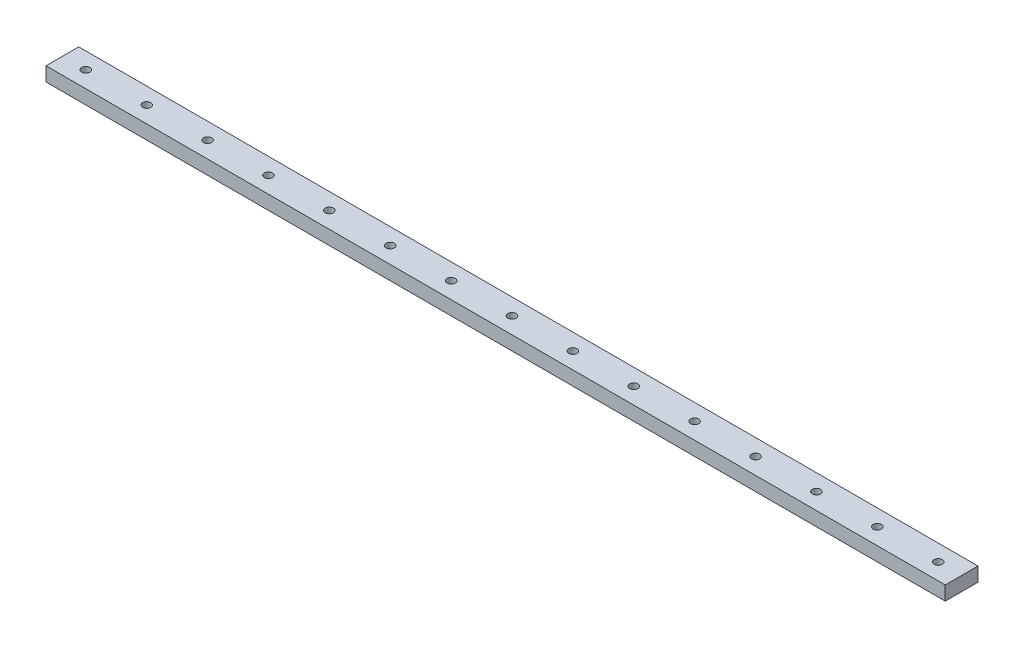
ISO-10303-21;
HEADER;
FILE_DESCRIPTION(('STEP AP214'),'2;1');
FILE_NAME('part.step','',(''),(''),'','','');
FILE_SCHEMA(('AUTOMOTIVE_DESIGN { 1 0 10303 214 1 1 1 1 }'));
ENDSEC;
DATA;
#1=APPLICATION_CONTEXT('core data for automotive mechanical design processes');
#2=APPLICATION_PROTOCOL_DEFINITION('international standard','automotive_design',2000,#1);
#3=PRODUCT_CONTEXT('',#1,'mechanical');
#4=PRODUCT('Part','Part','',(#3));
#5=PRODUCT_RELATED_PRODUCT_CATEGORY('part','',(#4));
#6=PRODUCT_DEFINITION_FORMATION('','',#4);
#7=PRODUCT_DEFINITION_CONTEXT('part definition',#1,'design');
#8=PRODUCT_DEFINITION('design','',#6,#7);
#9=PRODUCT_DEFINITION_SHAPE('','',#8);
#10=(LENGTH_UNIT() NAMED_UNIT(*) SI_UNIT(.MILLI.,.METRE.));
#11=(NAMED_UNIT(*) PLANE_ANGLE_UNIT() SI_UNIT($,.RADIAN.));
#12=(NAMED_UNIT(*) SI_UNIT($,.STERADIAN.) SOLID_ANGLE_UNIT());
#13=UNCERTAINTY_MEASURE_WITH_UNIT(LENGTH_MEASURE(1.E-05),#10,'distance_accuracy_value','');
#14=(GEOMETRIC_REPRESENTATION_CONTEXT(3) GLOBAL_UNCERTAINTY_ASSIGNED_CONTEXT((#13)) GLOBAL_UNIT_ASSIGNED_CONTEXT((#10,
#11,#12)) REPRESENTATION_CONTEXT('',''));
#15=CARTESIAN_POINT('',(0.,0.,0.));
#16=DIRECTION('',(0.,0.,1.));
#17=DIRECTION('',(1.,0.,0.));
#18=AXIS2_PLACEMENT_3D('',#15,#16,#17);
#19=CARTESIAN_POINT('',(0.,38.1,0.));
#20=DIRECTION('',(1.,0.,0.));
#21=DIRECTION('',(0.,0.,-1.));
#22=AXIS2_PLACEMENT_3D('',#19,#20,#21);
#23=PLANE('',#22);
#24=DIRECTION('',(0.,0.,1.));
#25=VECTOR('',#24,1.);
#26=CARTESIAN_POINT('',(0.,0.,0.));
#27=LINE('',#26,#25);
#28=CARTESIAN_POINT('',(0.,0.,-88.9));
#29=VERTEX_POINT('',#28);
#30=CARTESIAN_POINT('',(0.,0.,0.));
#31=VERTEX_POINT('',#30);
#32=EDGE_CURVE('E99',#29,#31,#27,.T.);
#33=ORIENTED_EDGE('',*,*,#32,.T.);
#34=DIRECTION('',(0.,-1.,0.));
#35=VECTOR('',#34,1.);
#36=CARTESIAN_POINT('',(0.,38.1,0.));
#37=LINE('',#36,#35);
#38=CARTESIAN_POINT('',(0.,38.1,0.));
#39=VERTEX_POINT('',#38);
#40=EDGE_CURVE('E11',#39,#31,#37,.T.);
#41=ORIENTED_EDGE('',*,*,#40,.F.);
#42=DIRECTION('',(0.,0.,1.));
#43=VECTOR('',#42,1.);
#44=CARTESIAN_POINT('',(0.,38.1,0.));
#45=LINE('',#44,#43);
#46=CARTESIAN_POINT('',(0.,38.1,-88.9));
#47=VERTEX_POINT('',#46);
#48=EDGE_CURVE('E87',#47,#39,#45,.T.);
#49=ORIENTED_EDGE('',*,*,#48,.F.);
#50=DIRECTION('',(0.,-1.,0.));
#51=VECTOR('',#50,1.);
#52=CARTESIAN_POINT('',(0.,38.1,-88.9));
#53=LINE('',#52,#51);
#54=EDGE_CURVE('E95',#47,#29,#53,.T.);
#55=ORIENTED_EDGE('',*,*,#54,.T.);
#56=EDGE_LOOP('',(#33,#41,#49,#55));
#57=FACE_BOUND('',#56,.T.);
#58=ADVANCED_FACE('F36',(#57),#23,.F.);
#59=CARTESIAN_POINT('',(0.,38.1,0.));
#60=DIRECTION('',(0.,0.,-1.));
#61=DIRECTION('',(-1.,0.,0.));
#62=AXIS2_PLACEMENT_3D('',#59,#60,#61);
#63=PLANE('',#62);
#64=DIRECTION('',(1.,0.,0.));
#65=VECTOR('',#64,1.);
#66=CARTESIAN_POINT('',(0.,0.,0.));
#67=LINE('',#66,#65);
#68=CARTESIAN_POINT('',(2438.4,0.,0.));
#69=VERTEX_POINT('',#68);
#70=EDGE_CURVE('E91',#31,#69,#67,.T.);
#71=ORIENTED_EDGE('',*,*,#70,.T.);
#72=DIRECTION('',(0.,-1.,0.));
#73=VECTOR('',#72,1.);
#74=CARTESIAN_POINT('',(2438.4,38.1,0.));
#75=LINE('',#74,#73);
#76=CARTESIAN_POINT('',(2438.4,38.1,0.));
#77=VERTEX_POINT('',#76);
#78=EDGE_CURVE('E44',#77,#69,#75,.T.);
#79=ORIENTED_EDGE('',*,*,#78,.F.);
#80=DIRECTION('',(1.,0.,0.));
#81=VECTOR('',#80,1.);
#82=CARTESIAN_POINT('',(0.,38.1,0.));
#83=LINE('',#82,#81);
#84=EDGE_CURVE('E82',#39,#77,#83,.T.);
#85=ORIENTED_EDGE('',*,*,#84,.F.);
#86=ORIENTED_EDGE('',*,*,#40,.T.);
#87=EDGE_LOOP('',(#71,#79,#85,#86));
#88=FACE_BOUND('',#87,.T.);
#89=ADVANCED_FACE('F90',(#88),#63,.F.);
#90=CARTESIAN_POINT('',(2438.4,38.1,0.));
#91=DIRECTION('',(-1.,0.,0.));
#92=DIRECTION('',(0.,0.,1.));
#93=AXIS2_PLACEMENT_3D('',#90,#91,#92);
#94=PLANE('',#93);
#95=DIRECTION('',(0.,0.,-1.));
#96=VECTOR('',#95,1.);
#97=CARTESIAN_POINT('',(2438.4,0.,0.));
#98=LINE('',#97,#96);
#99=CARTESIAN_POINT('',(2438.4,0.,-88.9));
#100=VERTEX_POINT('',#99);
#101=EDGE_CURVE('E69',#69,#100,#98,.T.);
#102=ORIENTED_EDGE('',*,*,#101,.T.);
#103=DIRECTION('',(0.,-1.,0.));
#104=VECTOR('',#103,1.);
#105=CARTESIAN_POINT('',(2438.4,38.1,-88.9));
#106=LINE('',#105,#104);
#107=CARTESIAN_POINT('',(2438.4,38.1,-88.9));
#108=VERTEX_POINT('',#107);
#109=EDGE_CURVE('E92',#108,#100,#106,.T.);
#110=ORIENTED_EDGE('',*,*,#109,.F.);
#111=DIRECTION('',(0.,0.,-1.));
#112=VECTOR('',#111,1.);
#113=CARTESIAN_POINT('',(2438.4,38.1,0.));
#114=LINE('',#113,#112);
#115=EDGE_CURVE('E85',#77,#108,#114,.T.);
#116=ORIENTED_EDGE('',*,*,#115,.F.);
#117=ORIENTED_EDGE('',*,*,#78,.T.);
#118=EDGE_LOOP('',(#102,#110,#116,#117));
#119=FACE_BOUND('',#118,.T.);
#120=ADVANCED_FACE('F93',(#119),#94,.F.);
#121=CARTESIAN_POINT('',(0.,38.1,-88.9));
#122=DIRECTION('',(0.,0.,1.));
#123=DIRECTION('',(1.,0.,0.));
#124=AXIS2_PLACEMENT_3D('',#121,#122,#123);
#125=PLANE('',#124);
#126=DIRECTION('',(-1.,0.,0.));
#127=VECTOR('',#126,1.);
#128=CARTESIAN_POINT('',(0.,0.,-88.9));
#129=LINE('',#128,#127);
#130=EDGE_CURVE('E75',#100,#29,#129,.T.);
#131=ORIENTED_EDGE('',*,*,#130,.T.);
#132=ORIENTED_EDGE('',*,*,#54,.F.);
#133=DIRECTION('',(-1.,0.,0.));
#134=VECTOR('',#133,1.);
#135=CARTESIAN_POINT('',(0.,38.1,-88.9));
#136=LINE('',#135,#134);
#137=EDGE_CURVE('E52',#108,#47,#136,.T.);
#138=ORIENTED_EDGE('',*,*,#137,.F.);
#139=ORIENTED_EDGE('',*,*,#109,.T.);
#140=EDGE_LOOP('',(#131,#132,#138,#139));
#141=FACE_BOUND('',#140,.T.);
#142=ADVANCED_FACE('F107',(#141),#125,.F.);
#143=CARTESIAN_POINT('',(0.,38.1,0.));
#144=DIRECTION('',(0.,-1.,0.));
#145=DIRECTION('',(0.,0.,-1.));
#146=AXIS2_PLACEMENT_3D('',#143,#144,#145);
#147=PLANE('',#146);
#148=CARTESIAN_POINT('',(63.5000000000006,38.1,-44.45));
#149=DIRECTION('',(0.,1.,0.));
#150=DIRECTION('',(0.,0.,1.));
#151=AXIS2_PLACEMENT_3D('',#148,#149,#150);
#152=CIRCLE('',#151,11.1125);
#153=CARTESIAN_POINT('',(63.5000000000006,38.1,-33.3375));
#154=VERTEX_POINT('',#153);
#155=EDGE_CURVE('E197',#154,#154,#152,.T.);
#156=ORIENTED_EDGE('',*,*,#155,.F.);
#157=EDGE_LOOP('',(#156));
#158=FACE_BOUND('',#157,.T.);
#159=CARTESIAN_POINT('',(228.600000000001,38.1,-44.45));
#160=DIRECTION('',(0.,1.,0.));
#161=DIRECTION('',(0.,0.,1.));
#162=AXIS2_PLACEMENT_3D('',#159,#160,#161);
#163=CIRCLE('',#162,11.1125);
#164=CARTESIAN_POINT('',(228.600000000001,38.1,-33.3375));
#165=VERTEX_POINT('',#164);
#166=EDGE_CURVE('E191',#165,#165,#163,.T.);
#167=ORIENTED_EDGE('',*,*,#166,.F.);
#168=EDGE_LOOP('',(#167));
#169=FACE_BOUND('',#168,.T.);
#170=CARTESIAN_POINT('',(393.700000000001,38.1,-44.45));
#171=DIRECTION('',(0.,1.,0.));
#172=DIRECTION('',(0.,0.,1.));
#173=AXIS2_PLACEMENT_3D('',#170,#171,#172);
#174=CIRCLE('',#173,11.1125);
#175=CARTESIAN_POINT('',(393.700000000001,38.1,-33.3375));
#176=VERTEX_POINT('',#175);
#177=EDGE_CURVE('E185',#176,#176,#174,.T.);
#178=ORIENTED_EDGE('',*,*,#177,.F.);
#179=EDGE_LOOP('',(#178));
#180=FACE_BOUND('',#179,.T.);
#181=CARTESIAN_POINT('',(558.800000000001,38.1,-44.45));
#182=DIRECTION('',(0.,1.,0.));
#183=DIRECTION('',(0.,0.,1.));
#184=AXIS2_PLACEMENT_3D('',#181,#182,#183);
#185=CIRCLE('',#184,11.1125);
#186=CARTESIAN_POINT('',(558.800000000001,38.1,-33.3375));
#187=VERTEX_POINT('',#186);
#188=EDGE_CURVE('E179',#187,#187,#185,.T.);
#189=ORIENTED_EDGE('',*,*,#188,.F.);
#190=EDGE_LOOP('',(#189));
#191=FACE_BOUND('',#190,.T.);
#192=CARTESIAN_POINT('',(723.900000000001,38.1,-44.45));
#193=DIRECTION('',(0.,1.,0.));
#194=DIRECTION('',(0.,0.,1.));
#195=AXIS2_PLACEMENT_3D('',#192,#193,#194);
#196=CIRCLE('',#195,11.1125);
#197=CARTESIAN_POINT('',(723.900000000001,38.1,-33.3375));
#198=VERTEX_POINT('',#197);
#199=EDGE_CURVE('E173',#198,#198,#196,.T.);
#200=ORIENTED_EDGE('',*,*,#199,.F.);
#201=EDGE_LOOP('',(#200));
#202=FACE_BOUND('',#201,.T.);
#203=CARTESIAN_POINT('',(889.000000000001,38.1,-44.45));
#204=DIRECTION('',(0.,1.,0.));
#205=DIRECTION('',(0.,0.,1.));
#206=AXIS2_PLACEMENT_3D('',#203,#204,#205);
#207=CIRCLE('',#206,11.1125);
#208=CARTESIAN_POINT('',(889.000000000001,38.1,-33.3375));
#209=VERTEX_POINT('',#208);
#210=EDGE_CURVE('E167',#209,#209,#207,.T.);
#211=ORIENTED_EDGE('',*,*,#210,.F.);
#212=EDGE_LOOP('',(#211));
#213=FACE_BOUND('',#212,.T.);
#214=CARTESIAN_POINT('',(1054.1,38.1,-44.45));
#215=DIRECTION('',(0.,1.,0.));
#216=DIRECTION('',(0.,0.,1.));
#217=AXIS2_PLACEMENT_3D('',#214,#215,#216);
#218=CIRCLE('',#217,11.1125000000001);
#219=CARTESIAN_POINT('',(1054.1,38.1,-33.3374999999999));
#220=VERTEX_POINT('',#219);
#221=EDGE_CURVE('E161',#220,#220,#218,.T.);
#222=ORIENTED_EDGE('',*,*,#221,.F.);
#223=EDGE_LOOP('',(#222));
#224=FACE_BOUND('',#223,.T.);
#225=CARTESIAN_POINT('',(1219.2,38.1,-44.45));
#226=DIRECTION('',(0.,1.,0.));
#227=DIRECTION('',(0.,0.,1.));
#228=AXIS2_PLACEMENT_3D('',#225,#226,#227);
#229=CIRCLE('',#228,11.1125000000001);
#230=CARTESIAN_POINT('',(1219.2,38.1,-33.3374999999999));
#231=VERTEX_POINT('',#230);
#232=EDGE_CURVE('E155',#231,#231,#229,.T.);
#233=ORIENTED_EDGE('',*,*,#232,.F.);
#234=EDGE_LOOP('',(#233));
#235=FACE_BOUND('',#234,.T.);
#236=CARTESIAN_POINT('',(1384.3,38.1,-44.45));
#237=DIRECTION('',(0.,1.,0.));
#238=DIRECTION('',(0.,0.,1.));
#239=AXIS2_PLACEMENT_3D('',#236,#237,#238);
#240=CIRCLE('',#239,11.1125000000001);
#241=CARTESIAN_POINT('',(1384.3,38.1,-33.3374999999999));
#242=VERTEX_POINT('',#241);
#243=EDGE_CURVE('E149',#242,#242,#240,.T.);
#244=ORIENTED_EDGE('',*,*,#243,.F.);
#245=EDGE_LOOP('',(#244));
#246=FACE_BOUND('',#245,.T.);
#247=CARTESIAN_POINT('',(1549.4,38.1,-44.45));
#248=DIRECTION('',(0.,1.,0.));
#249=DIRECTION('',(0.,0.,1.));
#250=AXIS2_PLACEMENT_3D('',#247,#248,#249);
#251=CIRCLE('',#250,11.1125000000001);
#252=CARTESIAN_POINT('',(1549.4,38.1,-33.3374999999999));
#253=VERTEX_POINT('',#252);
#254=EDGE_CURVE('E143',#253,#253,#251,.T.);
#255=ORIENTED_EDGE('',*,*,#254,.F.);
#256=EDGE_LOOP('',(#255));
#257=FACE_BOUND('',#256,.T.);
#258=CARTESIAN_POINT('',(1714.5,38.1,-44.45));
#259=DIRECTION('',(0.,1.,0.));
#260=DIRECTION('',(0.,0.,1.));
#261=AXIS2_PLACEMENT_3D('',#258,#259,#260);
#262=CIRCLE('',#261,11.1125000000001);
#263=CARTESIAN_POINT('',(1714.5,38.1,-33.3374999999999));
#264=VERTEX_POINT('',#263);
#265=EDGE_CURVE('E137',#264,#264,#262,.T.);
#266=ORIENTED_EDGE('',*,*,#265,.F.);
#267=EDGE_LOOP('',(#266));
#268=FACE_BOUND('',#267,.T.);
#269=CARTESIAN_POINT('',(1879.6,38.1,-44.45));
#270=DIRECTION('',(0.,1.,0.));
#271=DIRECTION('',(0.,0.,1.));
#272=AXIS2_PLACEMENT_3D('',#269,#270,#271);
#273=CIRCLE('',#272,11.1125000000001);
#274=CARTESIAN_POINT('',(1879.6,38.1,-33.3374999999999));
#275=VERTEX_POINT('',#274);
#276=EDGE_CURVE('E131',#275,#275,#273,.T.);
#277=ORIENTED_EDGE('',*,*,#276,.F.);
#278=EDGE_LOOP('',(#277));
#279=FACE_BOUND('',#278,.T.);
#280=CARTESIAN_POINT('',(2044.7,38.1,-44.45));
#281=DIRECTION('',(0.,1.,0.));
#282=DIRECTION('',(0.,0.,1.));
#283=AXIS2_PLACEMENT_3D('',#280,#281,#282);
#284=CIRCLE('',#283,11.1124999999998);
#285=CARTESIAN_POINT('',(2044.7,38.1,-33.3375000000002));
#286=VERTEX_POINT('',#285);
#287=EDGE_CURVE('E125',#286,#286,#284,.T.);
#288=ORIENTED_EDGE('',*,*,#287,.F.);
#289=EDGE_LOOP('',(#288));
#290=FACE_BOUND('',#289,.T.);
#291=CARTESIAN_POINT('',(2209.8,38.1,-44.45));
#292=DIRECTION('',(0.,1.,0.));
#293=DIRECTION('',(0.,0.,1.));
#294=AXIS2_PLACEMENT_3D('',#291,#292,#293);
#295=CIRCLE('',#294,11.1124999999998);
#296=CARTESIAN_POINT('',(2209.8,38.1,-33.3375000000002));
#297=VERTEX_POINT('',#296);
#298=EDGE_CURVE('E119',#297,#297,#295,.T.);
#299=ORIENTED_EDGE('',*,*,#298,.F.);
#300=EDGE_LOOP('',(#299));
#301=FACE_BOUND('',#300,.T.);
#302=CARTESIAN_POINT('',(2374.9,38.1,-44.45));
#303=DIRECTION('',(0.,1.,0.));
#304=DIRECTION('',(0.,0.,1.));
#305=AXIS2_PLACEMENT_3D('',#302,#303,#304);
#306=CIRCLE('',#305,11.1124999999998);
#307=CARTESIAN_POINT('',(2374.9,38.1,-33.3375000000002));
#308=VERTEX_POINT('',#307);
#309=EDGE_CURVE('E113',#308,#308,#306,.T.);
#310=ORIENTED_EDGE('',*,*,#309,.F.);
#311=EDGE_LOOP('',(#310));
#312=FACE_BOUND('',#311,.T.);
#313=ORIENTED_EDGE('',*,*,#48,.T.);
#314=ORIENTED_EDGE('',*,*,#84,.T.);
#315=ORIENTED_EDGE('',*,*,#115,.T.);
#316=ORIENTED_EDGE('',*,*,#137,.T.);
#317=EDGE_LOOP('',(#313,#314,#315,#316));
#318=FACE_BOUND('',#317,.T.);
#319=ADVANCED_FACE('F83',(#158,#169,#180,#191,#202,#213,#224,#235,#246,#257,#268,#279,#290,#301,
#312,#318),#147,.F.);
#320=CARTESIAN_POINT('',(0.,0.,0.));
#321=DIRECTION('',(0.,-1.,0.));
#322=DIRECTION('',(0.,0.,-1.));
#323=AXIS2_PLACEMENT_3D('',#320,#321,#322);
#324=PLANE('',#323);
#325=CARTESIAN_POINT('',(63.5000000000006,0.,-44.45));
#326=DIRECTION('',(0.,1.,0.));
#327=DIRECTION('',(0.,0.,1.));
#328=AXIS2_PLACEMENT_3D('',#325,#326,#327);
#329=CIRCLE('',#328,11.1125);
#330=CARTESIAN_POINT('',(63.5000000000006,0.,-33.3375));
#331=VERTEX_POINT('',#330);
#332=EDGE_CURVE('E102',#331,#331,#329,.T.);
#333=ORIENTED_EDGE('',*,*,#332,.T.);
#334=EDGE_LOOP('',(#333));
#335=FACE_BOUND('',#334,.T.);
#336=CARTESIAN_POINT('',(228.600000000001,0.,-44.45));
#337=DIRECTION('',(0.,1.,0.));
#338=DIRECTION('',(0.,0.,1.));
#339=AXIS2_PLACEMENT_3D('',#336,#337,#338);
#340=CIRCLE('',#339,11.1125);
#341=CARTESIAN_POINT('',(228.600000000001,0.,-33.3375));
#342=VERTEX_POINT('',#341);
#343=EDGE_CURVE('E194',#342,#342,#340,.T.);
#344=ORIENTED_EDGE('',*,*,#343,.T.);
#345=EDGE_LOOP('',(#344));
#346=FACE_BOUND('',#345,.T.);
#347=CARTESIAN_POINT('',(393.700000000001,0.,-44.45));
#348=DIRECTION('',(0.,1.,0.));
#349=DIRECTION('',(0.,0.,1.));
#350=AXIS2_PLACEMENT_3D('',#347,#348,#349);
#351=CIRCLE('',#350,11.1125);
#352=CARTESIAN_POINT('',(393.700000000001,0.,-33.3375));
#353=VERTEX_POINT('',#352);
#354=EDGE_CURVE('E188',#353,#353,#351,.T.);
#355=ORIENTED_EDGE('',*,*,#354,.T.);
#356=EDGE_LOOP('',(#355));
#357=FACE_BOUND('',#356,.T.);
#358=CARTESIAN_POINT('',(558.800000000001,0.,-44.45));
#359=DIRECTION('',(0.,1.,0.));
#360=DIRECTION('',(0.,0.,1.));
#361=AXIS2_PLACEMENT_3D('',#358,#359,#360);
#362=CIRCLE('',#361,11.1125);
#363=CARTESIAN_POINT('',(558.800000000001,0.,-33.3375));
#364=VERTEX_POINT('',#363);
#365=EDGE_CURVE('E182',#364,#364,#362,.T.);
#366=ORIENTED_EDGE('',*,*,#365,.T.);
#367=EDGE_LOOP('',(#366));
#368=FACE_BOUND('',#367,.T.);
#369=CARTESIAN_POINT('',(723.900000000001,0.,-44.45));
#370=DIRECTION('',(0.,1.,0.));
#371=DIRECTION('',(0.,0.,1.));
#372=AXIS2_PLACEMENT_3D('',#369,#370,#371);
#373=CIRCLE('',#372,11.1125);
#374=CARTESIAN_POINT('',(723.900000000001,0.,-33.3375));
#375=VERTEX_POINT('',#374);
#376=EDGE_CURVE('E176',#375,#375,#373,.T.);
#377=ORIENTED_EDGE('',*,*,#376,.T.);
#378=EDGE_LOOP('',(#377));
#379=FACE_BOUND('',#378,.T.);
#380=CARTESIAN_POINT('',(889.000000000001,0.,-44.45));
#381=DIRECTION('',(0.,1.,0.));
#382=DIRECTION('',(0.,0.,1.));
#383=AXIS2_PLACEMENT_3D('',#380,#381,#382);
#384=CIRCLE('',#383,11.1125);
#385=CARTESIAN_POINT('',(889.000000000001,0.,-33.3375));
#386=VERTEX_POINT('',#385);
#387=EDGE_CURVE('E170',#386,#386,#384,.T.);
#388=ORIENTED_EDGE('',*,*,#387,.T.);
#389=EDGE_LOOP('',(#388));
#390=FACE_BOUND('',#389,.T.);
#391=CARTESIAN_POINT('',(1054.1,0.,-44.45));
#392=DIRECTION('',(0.,1.,0.));
#393=DIRECTION('',(0.,0.,1.));
#394=AXIS2_PLACEMENT_3D('',#391,#392,#393);
#395=CIRCLE('',#394,11.1125000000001);
#396=CARTESIAN_POINT('',(1054.1,0.,-33.3374999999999));
#397=VERTEX_POINT('',#396);
#398=EDGE_CURVE('E164',#397,#397,#395,.T.);
#399=ORIENTED_EDGE('',*,*,#398,.T.);
#400=EDGE_LOOP('',(#399));
#401=FACE_BOUND('',#400,.T.);
#402=CARTESIAN_POINT('',(1219.2,0.,-44.45));
#403=DIRECTION('',(0.,1.,0.));
#404=DIRECTION('',(0.,0.,1.));
#405=AXIS2_PLACEMENT_3D('',#402,#403,#404);
#406=CIRCLE('',#405,11.1125000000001);
#407=CARTESIAN_POINT('',(1219.2,0.,-33.3374999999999));
#408=VERTEX_POINT('',#407);
#409=EDGE_CURVE('E158',#408,#408,#406,.T.);
#410=ORIENTED_EDGE('',*,*,#409,.T.);
#411=EDGE_LOOP('',(#410));
#412=FACE_BOUND('',#411,.T.);
#413=CARTESIAN_POINT('',(1384.3,0.,-44.45));
#414=DIRECTION('',(0.,1.,0.));
#415=DIRECTION('',(0.,0.,1.));
#416=AXIS2_PLACEMENT_3D('',#413,#414,#415);
#417=CIRCLE('',#416,11.1125000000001);
#418=CARTESIAN_POINT('',(1384.3,0.,-33.3374999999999));
#419=VERTEX_POINT('',#418);
#420=EDGE_CURVE('E152',#419,#419,#417,.T.);
#421=ORIENTED_EDGE('',*,*,#420,.T.);
#422=EDGE_LOOP('',(#421));
#423=FACE_BOUND('',#422,.T.);
#424=CARTESIAN_POINT('',(1549.4,0.,-44.45));
#425=DIRECTION('',(0.,1.,0.));
#426=DIRECTION('',(0.,0.,1.));
#427=AXIS2_PLACEMENT_3D('',#424,#425,#426);
#428=CIRCLE('',#427,11.1125000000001);
#429=CARTESIAN_POINT('',(1549.4,0.,-33.3374999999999));
#430=VERTEX_POINT('',#429);
#431=EDGE_CURVE('E146',#430,#430,#428,.T.);
#432=ORIENTED_EDGE('',*,*,#431,.T.);
#433=EDGE_LOOP('',(#432));
#434=FACE_BOUND('',#433,.T.);
#435=CARTESIAN_POINT('',(1714.5,0.,-44.45));
#436=DIRECTION('',(0.,1.,0.));
#437=DIRECTION('',(0.,0.,1.));
#438=AXIS2_PLACEMENT_3D('',#435,#436,#437);
#439=CIRCLE('',#438,11.1125000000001);
#440=CARTESIAN_POINT('',(1714.5,0.,-33.3374999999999));
#441=VERTEX_POINT('',#440);
#442=EDGE_CURVE('E140',#441,#441,#439,.T.);
#443=ORIENTED_EDGE('',*,*,#442,.T.);
#444=EDGE_LOOP('',(#443));
#445=FACE_BOUND('',#444,.T.);
#446=CARTESIAN_POINT('',(1879.6,0.,-44.45));
#447=DIRECTION('',(0.,1.,0.));
#448=DIRECTION('',(0.,0.,1.));
#449=AXIS2_PLACEMENT_3D('',#446,#447,#448);
#450=CIRCLE('',#449,11.1125000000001);
#451=CARTESIAN_POINT('',(1879.6,0.,-33.3374999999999));
#452=VERTEX_POINT('',#451);
#453=EDGE_CURVE('E134',#452,#452,#450,.T.);
#454=ORIENTED_EDGE('',*,*,#453,.T.);
#455=EDGE_LOOP('',(#454));
#456=FACE_BOUND('',#455,.T.);
#457=CARTESIAN_POINT('',(2044.7,0.,-44.45));
#458=DIRECTION('',(0.,1.,0.));
#459=DIRECTION('',(0.,0.,1.));
#460=AXIS2_PLACEMENT_3D('',#457,#458,#459);
#461=CIRCLE('',#460,11.1124999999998);
#462=CARTESIAN_POINT('',(2044.7,0.,-33.3375000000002));
#463=VERTEX_POINT('',#462);
#464=EDGE_CURVE('E128',#463,#463,#461,.T.);
#465=ORIENTED_EDGE('',*,*,#464,.T.);
#466=EDGE_LOOP('',(#465));
#467=FACE_BOUND('',#466,.T.);
#468=CARTESIAN_POINT('',(2209.8,0.,-44.45));
#469=DIRECTION('',(0.,1.,0.));
#470=DIRECTION('',(0.,0.,1.));
#471=AXIS2_PLACEMENT_3D('',#468,#469,#470);
#472=CIRCLE('',#471,11.1124999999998);
#473=CARTESIAN_POINT('',(2209.8,0.,-33.3375000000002));
#474=VERTEX_POINT('',#473);
#475=EDGE_CURVE('E122',#474,#474,#472,.T.);
#476=ORIENTED_EDGE('',*,*,#475,.T.);
#477=EDGE_LOOP('',(#476));
#478=FACE_BOUND('',#477,.T.);
#479=CARTESIAN_POINT('',(2374.9,0.,-44.45));
#480=DIRECTION('',(0.,1.,0.));
#481=DIRECTION('',(0.,0.,1.));
#482=AXIS2_PLACEMENT_3D('',#479,#480,#481);
#483=CIRCLE('',#482,11.1124999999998);
#484=CARTESIAN_POINT('',(2374.9,0.,-33.3375000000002));
#485=VERTEX_POINT('',#484);
#486=EDGE_CURVE('E116',#485,#485,#483,.T.);
#487=ORIENTED_EDGE('',*,*,#486,.T.);
#488=EDGE_LOOP('',(#487));
#489=FACE_BOUND('',#488,.T.);
#490=ORIENTED_EDGE('',*,*,#32,.F.);
#491=ORIENTED_EDGE('',*,*,#130,.F.);
#492=ORIENTED_EDGE('',*,*,#101,.F.);
#493=ORIENTED_EDGE('',*,*,#70,.F.);
#494=EDGE_LOOP('',(#490,#491,#492,#493));
#495=FACE_BOUND('',#494,.T.);
#496=ADVANCED_FACE('F110',(#335,#346,#357,#368,#379,#390,#401,#412,#423,#434,#445,#456,#467,
#478,#489,#495),#324,.T.);
#497=CARTESIAN_POINT('',(2374.9,0.,-44.45));
#498=DIRECTION('',(0.,1.,0.));
#499=DIRECTION('',(0.,0.,1.));
#500=AXIS2_PLACEMENT_3D('',#497,#498,#499);
#501=CYLINDRICAL_SURFACE('',#500,11.1124999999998);
#502=CARTESIAN_POINT('',(2374.9,0.,-33.3375000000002));
#503=CARTESIAN_POINT('',(2374.9,0.396875,-33.3375000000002));
#504=CARTESIAN_POINT('',(2374.9,0.79375,-33.3375000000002));
#505=CARTESIAN_POINT('',(2374.9,1.5875,-33.3375000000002));
#506=CARTESIAN_POINT('',(2374.9,1.984375,-33.3375000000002));
#507=CARTESIAN_POINT('',(2374.9,2.778125,-33.3375000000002));
#508=CARTESIAN_POINT('',(2374.9,3.175,-33.3375000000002));
#509=CARTESIAN_POINT('',(2374.9,3.96875,-33.3375000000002));
#510=CARTESIAN_POINT('',(2374.9,4.365625,-33.3375000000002));
#511=CARTESIAN_POINT('',(2374.9,5.159375,-33.3375000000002));
#512=CARTESIAN_POINT('',(2374.9,5.55625,-33.3375000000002));
#513=CARTESIAN_POINT('',(2374.9,6.35,-33.3375000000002));
#514=CARTESIAN_POINT('',(2374.9,6.746875,-33.3375000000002));
#515=CARTESIAN_POINT('',(2374.9,7.540625,-33.3375000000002));
#516=CARTESIAN_POINT('',(2374.9,7.9375,-33.3375000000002));
#517=CARTESIAN_POINT('',(2374.9,8.73125,-33.3375000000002));
#518=CARTESIAN_POINT('',(2374.9,9.128125,-33.3375000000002));
#519=CARTESIAN_POINT('',(2374.9,9.921875,-33.3375000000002));
#520=CARTESIAN_POINT('',(2374.9,10.31875,-33.3375000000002));
#521=CARTESIAN_POINT('',(2374.9,11.1125,-33.3375000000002));
#522=CARTESIAN_POINT('',(2374.9,11.509375,-33.3375000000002));
#523=CARTESIAN_POINT('',(2374.9,12.303125,-33.3375000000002));
#524=CARTESIAN_POINT('',(2374.9,12.7,-33.3375000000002));
#525=CARTESIAN_POINT('',(2374.9,13.49375,-33.3375000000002));
#526=CARTESIAN_POINT('',(2374.9,13.890625,-33.3375000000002));
#527=CARTESIAN_POINT('',(2374.9,14.684375,-33.3375000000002));
#528=CARTESIAN_POINT('',(2374.9,15.08125,-33.3375000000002));
#529=CARTESIAN_POINT('',(2374.9,15.875,-33.3375000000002));
#530=CARTESIAN_POINT('',(2374.9,16.271875,-33.3375000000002));
#531=CARTESIAN_POINT('',(2374.9,17.065625,-33.3375000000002));
#532=CARTESIAN_POINT('',(2374.9,17.4625,-33.3375000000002));
#533=CARTESIAN_POINT('',(2374.9,18.25625,-33.3375000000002));
#534=CARTESIAN_POINT('',(2374.9,18.653125,-33.3375000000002));
#535=CARTESIAN_POINT('',(2374.9,19.446875,-33.3375000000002));
#536=CARTESIAN_POINT('',(2374.9,19.84375,-33.3375000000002));
#537=CARTESIAN_POINT('',(2374.9,20.6375,-33.3375000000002));
#538=CARTESIAN_POINT('',(2374.9,21.034375,-33.3375000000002));
#539=CARTESIAN_POINT('',(2374.9,21.828125,-33.3375000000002));
#540=CARTESIAN_POINT('',(2374.9,22.225,-33.3375000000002));
#541=CARTESIAN_POINT('',(2374.9,23.01875,-33.3375000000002));
#542=CARTESIAN_POINT('',(2374.9,23.415625,-33.3375000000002));
#543=CARTESIAN_POINT('',(2374.9,24.209375,-33.3375000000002));
#544=CARTESIAN_POINT('',(2374.9,24.60625,-33.3375000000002));
#545=CARTESIAN_POINT('',(2374.9,25.4,-33.3375000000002));
#546=CARTESIAN_POINT('',(2374.9,25.796875,-33.3375000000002));
#547=CARTESIAN_POINT('',(2374.9,26.590625,-33.3375000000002));
#548=CARTESIAN_POINT('',(2374.9,26.9875,-33.3375000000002));
#549=CARTESIAN_POINT('',(2374.9,27.78125,-33.3375000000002));
#550=CARTESIAN_POINT('',(2374.9,28.178125,-33.3375000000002));
#551=CARTESIAN_POINT('',(2374.9,28.971875,-33.3375000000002));
#552=CARTESIAN_POINT('',(2374.9,29.36875,-33.3375000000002));
#553=CARTESIAN_POINT('',(2374.9,30.1625,-33.3375000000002));
#554=CARTESIAN_POINT('',(2374.9,30.559375,-33.3375000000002));
#555=CARTESIAN_POINT('',(2374.9,31.353125,-33.3375000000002));
#556=CARTESIAN_POINT('',(2374.9,31.75,-33.3375000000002));
#557=CARTESIAN_POINT('',(2374.9,32.54375,-33.3375000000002));
#558=CARTESIAN_POINT('',(2374.9,32.940625,-33.3375000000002));
#559=CARTESIAN_POINT('',(2374.9,33.734375,-33.3375000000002));
#560=CARTESIAN_POINT('',(2374.9,34.13125,-33.3375000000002));
#561=CARTESIAN_POINT('',(2374.9,34.925,-33.3375000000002));
#562=CARTESIAN_POINT('',(2374.9,35.321875,-33.3375000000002));
#563=CARTESIAN_POINT('',(2374.9,36.115625,-33.3375000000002));
#564=CARTESIAN_POINT('',(2374.9,36.5125,-33.3375000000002));
#565=CARTESIAN_POINT('',(2374.9,37.30625,-33.3375000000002));
#566=CARTESIAN_POINT('',(2374.9,37.703125,-33.3375000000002));
#567=CARTESIAN_POINT('',(2374.9,38.1,-33.3375000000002));
#568=B_SPLINE_CURVE_WITH_KNOTS('',3,(#502,#503,#504,#505,#506,#507,#508,#509,#510,#511,#512,
#513,#514,#515,#516,#517,#518,#519,#520,#521,#522,#523,#524,#525,#526,#527,#528,#529,#530,#531,
#532,#533,#534,#535,#536,#537,#538,#539,#540,#541,#542,#543,#544,#545,#546,#547,#548,#549,#550,
#551,#552,#553,#554,#555,#556,#557,#558,#559,#560,#561,#562,#563,#564,#565,#566,#567),
.UNSPECIFIED.,.F.,.F.,(4,2,2,2,2,2,2,2,2,2,2,2,2,2,2,2,2,2,2,2,2,2,2,2,2,2,2,2,2,2,2,2,4),(0.,
1.190625,2.38125,3.571875,4.7625,5.953125,7.14375,8.334375,9.525,10.715625,11.90625,13.096875,
14.2875,15.478125,16.66875,17.859375,19.05,20.240625,21.43125,22.621875,23.8125,25.003125,
26.19375,27.384375,28.575,29.765625,30.95625,32.146875,33.3375,34.528125,35.71875,36.909375,
38.1),.UNSPECIFIED.);
#569=EDGE_CURVE('BSEAM243',#485,#308,#568,.T.);
#570=ORIENTED_EDGE('',*,*,#486,.F.);
#571=ORIENTED_EDGE('',*,*,#309,.T.);
#572=ORIENTED_EDGE('',*,*,#569,.T.);
#573=ORIENTED_EDGE('',*,*,#569,.F.);
#574=EDGE_LOOP('',(#570,#572,#571,#573));
#575=FACE_BOUND('',#574,.T.);
#576=ADVANCED_FACE('F243',(#575),#501,.F.);
#577=CARTESIAN_POINT('',(2209.8,0.,-44.45));
#578=DIRECTION('',(0.,1.,0.));
#579=DIRECTION('',(0.,0.,1.));
#580=AXIS2_PLACEMENT_3D('',#577,#578,#579);
#581=CYLINDRICAL_SURFACE('',#580,11.1124999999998);
#582=CARTESIAN_POINT('',(2209.8,0.,-33.3375000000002));
#583=CARTESIAN_POINT('',(2209.8,0.396875,-33.3375000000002));
#584=CARTESIAN_POINT('',(2209.8,0.79375,-33.3375000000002));
#585=CARTESIAN_POINT('',(2209.8,1.5875,-33.3375000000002));
#586=CARTESIAN_POINT('',(2209.8,1.984375,-33.3375000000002));
#587=CARTESIAN_POINT('',(2209.8,2.778125,-33.3375000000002));
#588=CARTESIAN_POINT('',(2209.8,3.175,-33.3375000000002));
#589=CARTESIAN_POINT('',(2209.8,3.96875,-33.3375000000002));
#590=CARTESIAN_POINT('',(2209.8,4.365625,-33.3375000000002));
#591=CARTESIAN_POINT('',(2209.8,5.159375,-33.3375000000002));
#592=CARTESIAN_POINT('',(2209.8,5.55625,-33.3375000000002));
#593=CARTESIAN_POINT('',(2209.8,6.35,-33.3375000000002));
#594=CARTESIAN_POINT('',(2209.8,6.746875,-33.3375000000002));
#595=CARTESIAN_POINT('',(2209.8,7.540625,-33.3375000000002));
#596=CARTESIAN_POINT('',(2209.8,7.9375,-33.3375000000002));
#597=CARTESIAN_POINT('',(2209.8,8.73125,-33.3375000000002));
#598=CARTESIAN_POINT('',(2209.8,9.128125,-33.3375000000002));
#599=CARTESIAN_POINT('',(2209.8,9.921875,-33.3375000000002));
#600=CARTESIAN_POINT('',(2209.8,10.31875,-33.3375000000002));
#601=CARTESIAN_POINT('',(2209.8,11.1125,-33.3375000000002));
#602=CARTESIAN_POINT('',(2209.8,11.509375,-33.3375000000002));
#603=CARTESIAN_POINT('',(2209.8,12.303125,-33.3375000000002));
#604=CARTESIAN_POINT('',(2209.8,12.7,-33.3375000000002));
#605=CARTESIAN_POINT('',(2209.8,13.49375,-33.3375000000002));
#606=CARTESIAN_POINT('',(2209.8,13.890625,-33.3375000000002));
#607=CARTESIAN_POINT('',(2209.8,14.684375,-33.3375000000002));
#608=CARTESIAN_POINT('',(2209.8,15.08125,-33.3375000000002));
#609=CARTESIAN_POINT('',(2209.8,15.875,-33.3375000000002));
#610=CARTESIAN_POINT('',(2209.8,16.271875,-33.3375000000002));
#611=CARTESIAN_POINT('',(2209.8,17.065625,-33.3375000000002));
#612=CARTESIAN_POINT('',(2209.8,17.4625,-33.3375000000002));
#613=CARTESIAN_POINT('',(2209.8,18.25625,-33.3375000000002));
#614=CARTESIAN_POINT('',(2209.8,18.653125,-33.3375000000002));
#615=CARTESIAN_POINT('',(2209.8,19.446875,-33.3375000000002));
#616=CARTESIAN_POINT('',(2209.8,19.84375,-33.3375000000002));
#617=CARTESIAN_POINT('',(2209.8,20.6375,-33.3375000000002));
#618=CARTESIAN_POINT('',(2209.8,21.034375,-33.3375000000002));
#619=CARTESIAN_POINT('',(2209.8,21.828125,-33.3375000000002));
#620=CARTESIAN_POINT('',(2209.8,22.225,-33.3375000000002));
#621=CARTESIAN_POINT('',(2209.8,23.01875,-33.3375000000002));
#622=CARTESIAN_POINT('',(2209.8,23.415625,-33.3375000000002));
#623=CARTESIAN_POINT('',(2209.8,24.209375,-33.3375000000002));
#624=CARTESIAN_POINT('',(2209.8,24.60625,-33.3375000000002));
#625=CARTESIAN_POINT('',(2209.8,25.4,-33.3375000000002));
#626=CARTESIAN_POINT('',(2209.8,25.796875,-33.3375000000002));
#627=CARTESIAN_POINT('',(2209.8,26.590625,-33.3375000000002));
#628=CARTESIAN_POINT('',(2209.8,26.9875,-33.3375000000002));
#629=CARTESIAN_POINT('',(2209.8,27.78125,-33.3375000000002));
#630=CARTESIAN_POINT('',(2209.8,28.178125,-33.3375000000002));
#631=CARTESIAN_POINT('',(2209.8,28.971875,-33.3375000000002));
#632=CARTESIAN_POINT('',(2209.8,29.36875,-33.3375000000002));
#633=CARTESIAN_POINT('',(2209.8,30.1625,-33.3375000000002));
#634=CARTESIAN_POINT('',(2209.8,30.559375,-33.3375000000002));
#635=CARTESIAN_POINT('',(2209.8,31.353125,-33.3375000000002));
#636=CARTESIAN_POINT('',(2209.8,31.75,-33.3375000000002));
#637=CARTESIAN_POINT('',(2209.8,32.54375,-33.3375000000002));
#638=CARTESIAN_POINT('',(2209.8,32.940625,-33.3375000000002));
#639=CARTESIAN_POINT('',(2209.8,33.734375,-33.3375000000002));
#640=CARTESIAN_POINT('',(2209.8,34.13125,-33.3375000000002));
#641=CARTESIAN_POINT('',(2209.8,34.925,-33.3375000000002));
#642=CARTESIAN_POINT('',(2209.8,35.321875,-33.3375000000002));
#643=CARTESIAN_POINT('',(2209.8,36.115625,-33.3375000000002));
#644=CARTESIAN_POINT('',(2209.8,36.5125,-33.3375000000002));
#645=CARTESIAN_POINT('',(2209.8,37.30625,-33.3375000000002));
#646=CARTESIAN_POINT('',(2209.8,37.703125,-33.3375000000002));
#647=CARTESIAN_POINT('',(2209.8,38.1,-33.3375000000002));
#648=B_SPLINE_CURVE_WITH_KNOTS('',3,(#582,#583,#584,#585,#586,#587,#588,#589,#590,#591,#592,
#593,#594,#595,#596,#597,#598,#599,#600,#601,#602,#603,#604,#605,#606,#607,#608,#609,#610,#611,
#612,#613,#614,#615,#616,#617,#618,#619,#620,#621,#622,#623,#624,#625,#626,#627,#628,#629,#630,
#631,#632,#633,#634,#635,#636,#637,#638,#639,#640,#641,#642,#643,#644,#645,#646,#647),
.UNSPECIFIED.,.F.,.F.,(4,2,2,2,2,2,2,2,2,2,2,2,2,2,2,2,2,2,2,2,2,2,2,2,2,2,2,2,2,2,2,2,4),(0.,
1.190625,2.38125,3.571875,4.7625,5.953125,7.14375,8.334375,9.525,10.715625,11.90625,13.096875,
14.2875,15.478125,16.66875,17.859375,19.05,20.240625,21.43125,22.621875,23.8125,25.003125,
26.19375,27.384375,28.575,29.765625,30.95625,32.146875,33.3375,34.528125,35.71875,36.909375,
38.1),.UNSPECIFIED.);
#649=EDGE_CURVE('BSEAM245',#474,#297,#648,.T.);
#650=ORIENTED_EDGE('',*,*,#475,.F.);
#651=ORIENTED_EDGE('',*,*,#298,.T.);
#652=ORIENTED_EDGE('',*,*,#649,.T.);
#653=ORIENTED_EDGE('',*,*,#649,.F.);
#654=EDGE_LOOP('',(#650,#652,#651,#653));
#655=FACE_BOUND('',#654,.T.);
#656=ADVANCED_FACE('F245',(#655),#581,.F.);
#657=CARTESIAN_POINT('',(2044.7,0.,-44.45));
#658=DIRECTION('',(0.,1.,0.));
#659=DIRECTION('',(0.,0.,1.));
#660=AXIS2_PLACEMENT_3D('',#657,#658,#659);
#661=CYLINDRICAL_SURFACE('',#660,11.1124999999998);
#662=CARTESIAN_POINT('',(2044.7,0.,-33.3375000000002));
#663=CARTESIAN_POINT('',(2044.7,0.396875,-33.3375000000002));
#664=CARTESIAN_POINT('',(2044.7,0.79375,-33.3375000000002));
#665=CARTESIAN_POINT('',(2044.7,1.5875,-33.3375000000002));
#666=CARTESIAN_POINT('',(2044.7,1.984375,-33.3375000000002));
#667=CARTESIAN_POINT('',(2044.7,2.778125,-33.3375000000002));
#668=CARTESIAN_POINT('',(2044.7,3.175,-33.3375000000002));
#669=CARTESIAN_POINT('',(2044.7,3.96875,-33.3375000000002));
#670=CARTESIAN_POINT('',(2044.7,4.365625,-33.3375000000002));
#671=CARTESIAN_POINT('',(2044.7,5.159375,-33.3375000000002));
#672=CARTESIAN_POINT('',(2044.7,5.55625,-33.3375000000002));
#673=CARTESIAN_POINT('',(2044.7,6.35,-33.3375000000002));
#674=CARTESIAN_POINT('',(2044.7,6.746875,-33.3375000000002));
#675=CARTESIAN_POINT('',(2044.7,7.540625,-33.3375000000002));
#676=CARTESIAN_POINT('',(2044.7,7.9375,-33.3375000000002));
#677=CARTESIAN_POINT('',(2044.7,8.73125,-33.3375000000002));
#678=CARTESIAN_POINT('',(2044.7,9.128125,-33.3375000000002));
#679=CARTESIAN_POINT('',(2044.7,9.921875,-33.3375000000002));
#680=CARTESIAN_POINT('',(2044.7,10.31875,-33.3375000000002));
#681=CARTESIAN_POINT('',(2044.7,11.1125,-33.3375000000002));
#682=CARTESIAN_POINT('',(2044.7,11.509375,-33.3375000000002));
#683=CARTESIAN_POINT('',(2044.7,12.303125,-33.3375000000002));
#684=CARTESIAN_POINT('',(2044.7,12.7,-33.3375000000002));
#685=CARTESIAN_POINT('',(2044.7,13.49375,-33.3375000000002));
#686=CARTESIAN_POINT('',(2044.7,13.890625,-33.3375000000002));
#687=CARTESIAN_POINT('',(2044.7,14.684375,-33.3375000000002));
#688=CARTESIAN_POINT('',(2044.7,15.08125,-33.3375000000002));
#689=CARTESIAN_POINT('',(2044.7,15.875,-33.3375000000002));
#690=CARTESIAN_POINT('',(2044.7,16.271875,-33.3375000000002));
#691=CARTESIAN_POINT('',(2044.7,17.065625,-33.3375000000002));
#692=CARTESIAN_POINT('',(2044.7,17.4625,-33.3375000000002));
#693=CARTESIAN_POINT('',(2044.7,18.25625,-33.3375000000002));
#694=CARTESIAN_POINT('',(2044.7,18.653125,-33.3375000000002));
#695=CARTESIAN_POINT('',(2044.7,19.446875,-33.3375000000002));
#696=CARTESIAN_POINT('',(2044.7,19.84375,-33.3375000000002));
#697=CARTESIAN_POINT('',(2044.7,20.6375,-33.3375000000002));
#698=CARTESIAN_POINT('',(2044.7,21.034375,-33.3375000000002));
#699=CARTESIAN_POINT('',(2044.7,21.828125,-33.3375000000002));
#700=CARTESIAN_POINT('',(2044.7,22.225,-33.3375000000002));
#701=CARTESIAN_POINT('',(2044.7,23.01875,-33.3375000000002));
#702=CARTESIAN_POINT('',(2044.7,23.415625,-33.3375000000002));
#703=CARTESIAN_POINT('',(2044.7,24.209375,-33.3375000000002));
#704=CARTESIAN_POINT('',(2044.7,24.60625,-33.3375000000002));
#705=CARTESIAN_POINT('',(2044.7,25.4,-33.3375000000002));
#706=CARTESIAN_POINT('',(2044.7,25.796875,-33.3375000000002));
#707=CARTESIAN_POINT('',(2044.7,26.590625,-33.3375000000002));
#708=CARTESIAN_POINT('',(2044.7,26.9875,-33.3375000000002));
#709=CARTESIAN_POINT('',(2044.7,27.78125,-33.3375000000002));
#710=CARTESIAN_POINT('',(2044.7,28.178125,-33.3375000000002));
#711=CARTESIAN_POINT('',(2044.7,28.971875,-33.3375000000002));
#712=CARTESIAN_POINT('',(2044.7,29.36875,-33.3375000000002));
#713=CARTESIAN_POINT('',(2044.7,30.1625,-33.3375000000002));
#714=CARTESIAN_POINT('',(2044.7,30.559375,-33.3375000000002));
#715=CARTESIAN_POINT('',(2044.7,31.353125,-33.3375000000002));
#716=CARTESIAN_POINT('',(2044.7,31.75,-33.3375000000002));
#717=CARTESIAN_POINT('',(2044.7,32.54375,-33.3375000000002));
#718=CARTESIAN_POINT('',(2044.7,32.940625,-33.3375000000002));
#719=CARTESIAN_POINT('',(2044.7,33.734375,-33.3375000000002));
#720=CARTESIAN_POINT('',(2044.7,34.13125,-33.3375000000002));
#721=CARTESIAN_POINT('',(2044.7,34.925,-33.3375000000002));
#722=CARTESIAN_POINT('',(2044.7,35.321875,-33.3375000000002));
#723=CARTESIAN_POINT('',(2044.7,36.115625,-33.3375000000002));
#724=CARTESIAN_POINT('',(2044.7,36.5125,-33.3375000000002));
#725=CARTESIAN_POINT('',(2044.7,37.30625,-33.3375000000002));
#726=CARTESIAN_POINT('',(2044.7,37.703125,-33.3375000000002));
#727=CARTESIAN_POINT('',(2044.7,38.1,-33.3375000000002));
#728=B_SPLINE_CURVE_WITH_KNOTS('',3,(#662,#663,#664,#665,#666,#667,#668,#669,#670,#671,#672,
#673,#674,#675,#676,#677,#678,#679,#680,#681,#682,#683,#684,#685,#686,#687,#688,#689,#690,#691,
#692,#693,#694,#695,#696,#697,#698,#699,#700,#701,#702,#703,#704,#705,#706,#707,#708,#709,#710,
#711,#712,#713,#714,#715,#716,#717,#718,#719,#720,#721,#722,#723,#724,#725,#726,#727),
.UNSPECIFIED.,.F.,.F.,(4,2,2,2,2,2,2,2,2,2,2,2,2,2,2,2,2,2,2,2,2,2,2,2,2,2,2,2,2,2,2,2,4),(0.,
1.190625,2.38125,3.571875,4.7625,5.953125,7.14375,8.334375,9.525,10.715625,11.90625,13.096875,
14.2875,15.478125,16.66875,17.859375,19.05,20.240625,21.43125,22.621875,23.8125,25.003125,
26.19375,27.384375,28.575,29.765625,30.95625,32.146875,33.3375,34.528125,35.71875,36.909375,
38.1),.UNSPECIFIED.);
#729=EDGE_CURVE('BSEAM252',#463,#286,#728,.T.);
#730=ORIENTED_EDGE('',*,*,#464,.F.);
#731=ORIENTED_EDGE('',*,*,#287,.T.);
#732=ORIENTED_EDGE('',*,*,#729,.T.);
#733=ORIENTED_EDGE('',*,*,#729,.F.);
#734=EDGE_LOOP('',(#730,#732,#731,#733));
#735=FACE_BOUND('',#734,.T.);
#736=ADVANCED_FACE('F252',(#735),#661,.F.);
#737=CARTESIAN_POINT('',(1879.6,0.,-44.45));
#738=DIRECTION('',(0.,1.,0.));
#739=DIRECTION('',(0.,0.,1.));
#740=AXIS2_PLACEMENT_3D('',#737,#738,#739);
#741=CYLINDRICAL_SURFACE('',#740,11.1125000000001);
#742=CARTESIAN_POINT('',(1879.6,0.,-33.3374999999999));
#743=CARTESIAN_POINT('',(1879.6,0.396875,-33.3374999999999));
#744=CARTESIAN_POINT('',(1879.6,0.79375,-33.3374999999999));
#745=CARTESIAN_POINT('',(1879.6,1.5875,-33.3374999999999));
#746=CARTESIAN_POINT('',(1879.6,1.984375,-33.3374999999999));
#747=CARTESIAN_POINT('',(1879.6,2.778125,-33.3374999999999));
#748=CARTESIAN_POINT('',(1879.6,3.175,-33.3374999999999));
#749=CARTESIAN_POINT('',(1879.6,3.96875,-33.3374999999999));
#750=CARTESIAN_POINT('',(1879.6,4.365625,-33.3374999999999));
#751=CARTESIAN_POINT('',(1879.6,5.159375,-33.3374999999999));
#752=CARTESIAN_POINT('',(1879.6,5.55625,-33.3374999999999));
#753=CARTESIAN_POINT('',(1879.6,6.35,-33.3374999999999));
#754=CARTESIAN_POINT('',(1879.6,6.746875,-33.3374999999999));
#755=CARTESIAN_POINT('',(1879.6,7.540625,-33.3374999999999));
#756=CARTESIAN_POINT('',(1879.6,7.9375,-33.3374999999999));
#757=CARTESIAN_POINT('',(1879.6,8.73125,-33.3374999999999));
#758=CARTESIAN_POINT('',(1879.6,9.128125,-33.3374999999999));
#759=CARTESIAN_POINT('',(1879.6,9.921875,-33.3374999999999));
#760=CARTESIAN_POINT('',(1879.6,10.31875,-33.3374999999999));
#761=CARTESIAN_POINT('',(1879.6,11.1125,-33.3374999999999));
#762=CARTESIAN_POINT('',(1879.6,11.509375,-33.3374999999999));
#763=CARTESIAN_POINT('',(1879.6,12.303125,-33.3374999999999));
#764=CARTESIAN_POINT('',(1879.6,12.7,-33.3374999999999));
#765=CARTESIAN_POINT('',(1879.6,13.49375,-33.3374999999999));
#766=CARTESIAN_POINT('',(1879.6,13.890625,-33.3374999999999));
#767=CARTESIAN_POINT('',(1879.6,14.684375,-33.3374999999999));
#768=CARTESIAN_POINT('',(1879.6,15.08125,-33.3374999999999));
#769=CARTESIAN_POINT('',(1879.6,15.875,-33.3374999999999));
#770=CARTESIAN_POINT('',(1879.6,16.271875,-33.3374999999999));
#771=CARTESIAN_POINT('',(1879.6,17.065625,-33.3374999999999));
#772=CARTESIAN_POINT('',(1879.6,17.4625,-33.3374999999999));
#773=CARTESIAN_POINT('',(1879.6,18.25625,-33.3374999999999));
#774=CARTESIAN_POINT('',(1879.6,18.653125,-33.3374999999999));
#775=CARTESIAN_POINT('',(1879.6,19.446875,-33.3374999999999));
#776=CARTESIAN_POINT('',(1879.6,19.84375,-33.3374999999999));
#777=CARTESIAN_POINT('',(1879.6,20.6375,-33.3374999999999));
#778=CARTESIAN_POINT('',(1879.6,21.034375,-33.3374999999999));
#779=CARTESIAN_POINT('',(1879.6,21.828125,-33.3374999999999));
#780=CARTESIAN_POINT('',(1879.6,22.225,-33.3374999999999));
#781=CARTESIAN_POINT('',(1879.6,23.01875,-33.3374999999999));
#782=CARTESIAN_POINT('',(1879.6,23.415625,-33.3374999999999));
#783=CARTESIAN_POINT('',(1879.6,24.209375,-33.3374999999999));
#784=CARTESIAN_POINT('',(1879.6,24.60625,-33.3374999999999));
#785=CARTESIAN_POINT('',(1879.6,25.4,-33.3374999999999));
#786=CARTESIAN_POINT('',(1879.6,25.796875,-33.3374999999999));
#787=CARTESIAN_POINT('',(1879.6,26.590625,-33.3374999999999));
#788=CARTESIAN_POINT('',(1879.6,26.9875,-33.3374999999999));
#789=CARTESIAN_POINT('',(1879.6,27.78125,-33.3374999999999));
#790=CARTESIAN_POINT('',(1879.6,28.178125,-33.3374999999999));
#791=CARTESIAN_POINT('',(1879.6,28.971875,-33.3374999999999));
#792=CARTESIAN_POINT('',(1879.6,29.36875,-33.3374999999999));
#793=CARTESIAN_POINT('',(1879.6,30.1625,-33.3374999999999));
#794=CARTESIAN_POINT('',(1879.6,30.559375,-33.3374999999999));
#795=CARTESIAN_POINT('',(1879.6,31.353125,-33.3374999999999));
#796=CARTESIAN_POINT('',(1879.6,31.75,-33.3374999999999));
#797=CARTESIAN_POINT('',(1879.6,32.54375,-33.3374999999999));
#798=CARTESIAN_POINT('',(1879.6,32.940625,-33.3374999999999));
#799=CARTESIAN_POINT('',(1879.6,33.734375,-33.3374999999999));
#800=CARTESIAN_POINT('',(1879.6,34.13125,-33.3374999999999));
#801=CARTESIAN_POINT('',(1879.6,34.925,-33.3374999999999));
#802=CARTESIAN_POINT('',(1879.6,35.321875,-33.3374999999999));
#803=CARTESIAN_POINT('',(1879.6,36.115625,-33.3374999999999));
#804=CARTESIAN_POINT('',(1879.6,36.5125,-33.3374999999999));
#805=CARTESIAN_POINT('',(1879.6,37.30625,-33.3374999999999));
#806=CARTESIAN_POINT('',(1879.6,37.703125,-33.3374999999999));
#807=CARTESIAN_POINT('',(1879.6,38.1,-33.3374999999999));
#808=B_SPLINE_CURVE_WITH_KNOTS('',3,(#742,#743,#744,#745,#746,#747,#748,#749,#750,#751,#752,
#753,#754,#755,#756,#757,#758,#759,#760,#761,#762,#763,#764,#765,#766,#767,#768,#769,#770,#771,
#772,#773,#774,#775,#776,#777,#778,#779,#780,#781,#782,#783,#784,#785,#786,#787,#788,#789,#790,
#791,#792,#793,#794,#795,#796,#797,#798,#799,#800,#801,#802,#803,#804,#805,#806,#807),
.UNSPECIFIED.,.F.,.F.,(4,2,2,2,2,2,2,2,2,2,2,2,2,2,2,2,2,2,2,2,2,2,2,2,2,2,2,2,2,2,2,2,4),(0.,
1.190625,2.38125,3.571875,4.7625,5.953125,7.14375,8.334375,9.525,10.715625,11.90625,13.096875,
14.2875,15.478125,16.66875,17.859375,19.05,20.240625,21.43125,22.621875,23.8125,25.003125,
26.19375,27.384375,28.575,29.765625,30.95625,32.146875,33.3375,34.528125,35.71875,36.909375,
38.1),.UNSPECIFIED.);
#809=EDGE_CURVE('BSEAM298',#452,#275,#808,.T.);
#810=ORIENTED_EDGE('',*,*,#453,.F.);
#811=ORIENTED_EDGE('',*,*,#276,.T.);
#812=ORIENTED_EDGE('',*,*,#809,.T.);
#813=ORIENTED_EDGE('',*,*,#809,.F.);
#814=EDGE_LOOP('',(#810,#812,#811,#813));
#815=FACE_BOUND('',#814,.T.);
#816=ADVANCED_FACE('F298',(#815),#741,.F.);
#817=CARTESIAN_POINT('',(1714.5,0.,-44.45));
#818=DIRECTION('',(0.,1.,0.));
#819=DIRECTION('',(0.,0.,1.));
#820=AXIS2_PLACEMENT_3D('',#817,#818,#819);
#821=CYLINDRICAL_SURFACE('',#820,11.1125000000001);
#822=CARTESIAN_POINT('',(1714.5,0.,-33.3374999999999));
#823=CARTESIAN_POINT('',(1714.5,0.396875,-33.3374999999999));
#824=CARTESIAN_POINT('',(1714.5,0.79375,-33.3374999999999));
#825=CARTESIAN_POINT('',(1714.5,1.5875,-33.3374999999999));
#826=CARTESIAN_POINT('',(1714.5,1.984375,-33.3374999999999));
#827=CARTESIAN_POINT('',(1714.5,2.778125,-33.3374999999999));
#828=CARTESIAN_POINT('',(1714.5,3.175,-33.3374999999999));
#829=CARTESIAN_POINT('',(1714.5,3.96875,-33.3374999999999));
#830=CARTESIAN_POINT('',(1714.5,4.365625,-33.3374999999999));
#831=CARTESIAN_POINT('',(1714.5,5.159375,-33.3374999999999));
#832=CARTESIAN_POINT('',(1714.5,5.55625,-33.3374999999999));
#833=CARTESIAN_POINT('',(1714.5,6.35,-33.3374999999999));
#834=CARTESIAN_POINT('',(1714.5,6.746875,-33.3374999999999));
#835=CARTESIAN_POINT('',(1714.5,7.540625,-33.3374999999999));
#836=CARTESIAN_POINT('',(1714.5,7.9375,-33.3374999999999));
#837=CARTESIAN_POINT('',(1714.5,8.73125,-33.3374999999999));
#838=CARTESIAN_POINT('',(1714.5,9.128125,-33.3374999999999));
#839=CARTESIAN_POINT('',(1714.5,9.921875,-33.3374999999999));
#840=CARTESIAN_POINT('',(1714.5,10.31875,-33.3374999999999));
#841=CARTESIAN_POINT('',(1714.5,11.1125,-33.3374999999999));
#842=CARTESIAN_POINT('',(1714.5,11.509375,-33.3374999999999));
#843=CARTESIAN_POINT('',(1714.5,12.303125,-33.3374999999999));
#844=CARTESIAN_POINT('',(1714.5,12.7,-33.3374999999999));
#845=CARTESIAN_POINT('',(1714.5,13.49375,-33.3374999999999));
#846=CARTESIAN_POINT('',(1714.5,13.890625,-33.3374999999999));
#847=CARTESIAN_POINT('',(1714.5,14.684375,-33.3374999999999));
#848=CARTESIAN_POINT('',(1714.5,15.08125,-33.3374999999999));
#849=CARTESIAN_POINT('',(1714.5,15.875,-33.3374999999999));
#850=CARTESIAN_POINT('',(1714.5,16.271875,-33.3374999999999));
#851=CARTESIAN_POINT('',(1714.5,17.065625,-33.3374999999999));
#852=CARTESIAN_POINT('',(1714.5,17.4625,-33.3374999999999));
#853=CARTESIAN_POINT('',(1714.5,18.25625,-33.3374999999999));
#854=CARTESIAN_POINT('',(1714.5,18.653125,-33.3374999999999));
#855=CARTESIAN_POINT('',(1714.5,19.446875,-33.3374999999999));
#856=CARTESIAN_POINT('',(1714.5,19.84375,-33.3374999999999));
#857=CARTESIAN_POINT('',(1714.5,20.6375,-33.3374999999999));
#858=CARTESIAN_POINT('',(1714.5,21.034375,-33.3374999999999));
#859=CARTESIAN_POINT('',(1714.5,21.828125,-33.3374999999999));
#860=CARTESIAN_POINT('',(1714.5,22.225,-33.3374999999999));
#861=CARTESIAN_POINT('',(1714.5,23.01875,-33.3374999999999));
#862=CARTESIAN_POINT('',(1714.5,23.415625,-33.3374999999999));
#863=CARTESIAN_POINT('',(1714.5,24.209375,-33.3374999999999));
#864=CARTESIAN_POINT('',(1714.5,24.60625,-33.3374999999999));
#865=CARTESIAN_POINT('',(1714.5,25.4,-33.3374999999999));
#866=CARTESIAN_POINT('',(1714.5,25.796875,-33.3374999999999));
#867=CARTESIAN_POINT('',(1714.5,26.590625,-33.3374999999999));
#868=CARTESIAN_POINT('',(1714.5,26.9875,-33.3374999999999));
#869=CARTESIAN_POINT('',(1714.5,27.78125,-33.3374999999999));
#870=CARTESIAN_POINT('',(1714.5,28.178125,-33.3374999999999));
#871=CARTESIAN_POINT('',(1714.5,28.971875,-33.3374999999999));
#872=CARTESIAN_POINT('',(1714.5,29.36875,-33.3374999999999));
#873=CARTESIAN_POINT('',(1714.5,30.1625,-33.3374999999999));
#874=CARTESIAN_POINT('',(1714.5,30.559375,-33.3374999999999));
#875=CARTESIAN_POINT('',(1714.5,31.353125,-33.3374999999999));
#876=CARTESIAN_POINT('',(1714.5,31.75,-33.3374999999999));
#877=CARTESIAN_POINT('',(1714.5,32.54375,-33.3374999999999));
#878=CARTESIAN_POINT('',(1714.5,32.940625,-33.3374999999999));
#879=CARTESIAN_POINT('',(1714.5,33.734375,-33.3374999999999));
#880=CARTESIAN_POINT('',(1714.5,34.13125,-33.3374999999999));
#881=CARTESIAN_POINT('',(1714.5,34.925,-33.3374999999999));
#882=CARTESIAN_POINT('',(1714.5,35.321875,-33.3374999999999));
#883=CARTESIAN_POINT('',(1714.5,36.115625,-33.3374999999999));
#884=CARTESIAN_POINT('',(1714.5,36.5125,-33.3374999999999));
#885=CARTESIAN_POINT('',(1714.5,37.30625,-33.3374999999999));
#886=CARTESIAN_POINT('',(1714.5,37.703125,-33.3374999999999));
#887=CARTESIAN_POINT('',(1714.5,38.1,-33.3374999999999));
#888=B_SPLINE_CURVE_WITH_KNOTS('',3,(#822,#823,#824,#825,#826,#827,#828,#829,#830,#831,#832,
#833,#834,#835,#836,#837,#838,#839,#840,#841,#842,#843,#844,#845,#846,#847,#848,#849,#850,#851,
#852,#853,#854,#855,#856,#857,#858,#859,#860,#861,#862,#863,#864,#865,#866,#867,#868,#869,#870,
#871,#872,#873,#874,#875,#876,#877,#878,#879,#880,#881,#882,#883,#884,#885,#886,#887),
.UNSPECIFIED.,.F.,.F.,(4,2,2,2,2,2,2,2,2,2,2,2,2,2,2,2,2,2,2,2,2,2,2,2,2,2,2,2,2,2,2,2,4),(0.,
1.190625,2.38125,3.571875,4.7625,5.953125,7.14375,8.334375,9.525,10.715625,11.90625,13.096875,
14.2875,15.478125,16.66875,17.859375,19.05,20.240625,21.43125,22.621875,23.8125,25.003125,
26.19375,27.384375,28.575,29.765625,30.95625,32.146875,33.3375,34.528125,35.71875,36.909375,
38.1),.UNSPECIFIED.);
#889=EDGE_CURVE('BSEAM308',#441,#264,#888,.T.);
#890=ORIENTED_EDGE('',*,*,#442,.F.);
#891=ORIENTED_EDGE('',*,*,#265,.T.);
#892=ORIENTED_EDGE('',*,*,#889,.T.);
#893=ORIENTED_EDGE('',*,*,#889,.F.);
#894=EDGE_LOOP('',(#890,#892,#891,#893));
#895=FACE_BOUND('',#894,.T.);
#896=ADVANCED_FACE('F308',(#895),#821,.F.);
#897=CARTESIAN_POINT('',(1549.4,0.,-44.45));
#898=DIRECTION('',(0.,1.,0.));
#899=DIRECTION('',(0.,0.,1.));
#900=AXIS2_PLACEMENT_3D('',#897,#898,#899);
#901=CYLINDRICAL_SURFACE('',#900,11.1125000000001);
#902=CARTESIAN_POINT('',(1549.4,0.,-33.3374999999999));
#903=CARTESIAN_POINT('',(1549.4,0.396875,-33.3374999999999));
#904=CARTESIAN_POINT('',(1549.4,0.79375,-33.3374999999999));
#905=CARTESIAN_POINT('',(1549.4,1.5875,-33.3374999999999));
#906=CARTESIAN_POINT('',(1549.4,1.984375,-33.3374999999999));
#907=CARTESIAN_POINT('',(1549.4,2.778125,-33.3374999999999));
#908=CARTESIAN_POINT('',(1549.4,3.175,-33.3374999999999));
#909=CARTESIAN_POINT('',(1549.4,3.96875,-33.3374999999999));
#910=CARTESIAN_POINT('',(1549.4,4.365625,-33.3374999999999));
#911=CARTESIAN_POINT('',(1549.4,5.159375,-33.3374999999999));
#912=CARTESIAN_POINT('',(1549.4,5.55625,-33.3374999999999));
#913=CARTESIAN_POINT('',(1549.4,6.35,-33.3374999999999));
#914=CARTESIAN_POINT('',(1549.4,6.746875,-33.3374999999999));
#915=CARTESIAN_POINT('',(1549.4,7.540625,-33.3374999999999));
#916=CARTESIAN_POINT('',(1549.4,7.9375,-33.3374999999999));
#917=CARTESIAN_POINT('',(1549.4,8.73125,-33.3374999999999));
#918=CARTESIAN_POINT('',(1549.4,9.128125,-33.3374999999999));
#919=CARTESIAN_POINT('',(1549.4,9.921875,-33.3374999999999));
#920=CARTESIAN_POINT('',(1549.4,10.31875,-33.3374999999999));
#921=CARTESIAN_POINT('',(1549.4,11.1125,-33.3374999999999));
#922=CARTESIAN_POINT('',(1549.4,11.509375,-33.3374999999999));
#923=CARTESIAN_POINT('',(1549.4,12.303125,-33.3374999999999));
#924=CARTESIAN_POINT('',(1549.4,12.7,-33.3374999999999));
#925=CARTESIAN_POINT('',(1549.4,13.49375,-33.3374999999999));
#926=CARTESIAN_POINT('',(1549.4,13.890625,-33.3374999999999));
#927=CARTESIAN_POINT('',(1549.4,14.684375,-33.3374999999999));
#928=CARTESIAN_POINT('',(1549.4,15.08125,-33.3374999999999));
#929=CARTESIAN_POINT('',(1549.4,15.875,-33.3374999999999));
#930=CARTESIAN_POINT('',(1549.4,16.271875,-33.3374999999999));
#931=CARTESIAN_POINT('',(1549.4,17.065625,-33.3374999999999));
#932=CARTESIAN_POINT('',(1549.4,17.4625,-33.3374999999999));
#933=CARTESIAN_POINT('',(1549.4,18.25625,-33.3374999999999));
#934=CARTESIAN_POINT('',(1549.4,18.653125,-33.3374999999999));
#935=CARTESIAN_POINT('',(1549.4,19.446875,-33.3374999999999));
#936=CARTESIAN_POINT('',(1549.4,19.84375,-33.3374999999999));
#937=CARTESIAN_POINT('',(1549.4,20.6375,-33.3374999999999));
#938=CARTESIAN_POINT('',(1549.4,21.034375,-33.3374999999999));
#939=CARTESIAN_POINT('',(1549.4,21.828125,-33.3374999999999));
#940=CARTESIAN_POINT('',(1549.4,22.225,-33.3374999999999));
#941=CARTESIAN_POINT('',(1549.4,23.01875,-33.3374999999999));
#942=CARTESIAN_POINT('',(1549.4,23.415625,-33.3374999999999));
#943=CARTESIAN_POINT('',(1549.4,24.209375,-33.3374999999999));
#944=CARTESIAN_POINT('',(1549.4,24.60625,-33.3374999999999));
#945=CARTESIAN_POINT('',(1549.4,25.4,-33.3374999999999));
#946=CARTESIAN_POINT('',(1549.4,25.796875,-33.3374999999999));
#947=CARTESIAN_POINT('',(1549.4,26.590625,-33.3374999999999));
#948=CARTESIAN_POINT('',(1549.4,26.9875,-33.3374999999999));
#949=CARTESIAN_POINT('',(1549.4,27.78125,-33.3374999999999));
#950=CARTESIAN_POINT('',(1549.4,28.178125,-33.3374999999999));
#951=CARTESIAN_POINT('',(1549.4,28.971875,-33.3374999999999));
#952=CARTESIAN_POINT('',(1549.4,29.36875,-33.3374999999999));
#953=CARTESIAN_POINT('',(1549.4,30.1625,-33.3374999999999));
#954=CARTESIAN_POINT('',(1549.4,30.559375,-33.3374999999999));
#955=CARTESIAN_POINT('',(1549.4,31.353125,-33.3374999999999));
#956=CARTESIAN_POINT('',(1549.4,31.75,-33.3374999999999));
#957=CARTESIAN_POINT('',(1549.4,32.54375,-33.3374999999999));
#958=CARTESIAN_POINT('',(1549.4,32.940625,-33.3374999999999));
#959=CARTESIAN_POINT('',(1549.4,33.734375,-33.3374999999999));
#960=CARTESIAN_POINT('',(1549.4,34.13125,-33.3374999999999));
#961=CARTESIAN_POINT('',(1549.4,34.925,-33.3374999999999));
#962=CARTESIAN_POINT('',(1549.4,35.321875,-33.3374999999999));
#963=CARTESIAN_POINT('',(1549.4,36.115625,-33.3374999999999));
#964=CARTESIAN_POINT('',(1549.4,36.5125,-33.3374999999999));
#965=CARTESIAN_POINT('',(1549.4,37.30625,-33.3374999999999));
#966=CARTESIAN_POINT('',(1549.4,37.703125,-33.3374999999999));
#967=CARTESIAN_POINT('',(1549.4,38.1,-33.3374999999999));
#968=B_SPLINE_CURVE_WITH_KNOTS('',3,(#902,#903,#904,#905,#906,#907,#908,#909,#910,#911,#912,
#913,#914,#915,#916,#917,#918,#919,#920,#921,#922,#923,#924,#925,#926,#927,#928,#929,#930,#931,
#932,#933,#934,#935,#936,#937,#938,#939,#940,#941,#942,#943,#944,#945,#946,#947,#948,#949,#950,
#951,#952,#953,#954,#955,#956,#957,#958,#959,#960,#961,#962,#963,#964,#965,#966,#967),
.UNSPECIFIED.,.F.,.F.,(4,2,2,2,2,2,2,2,2,2,2,2,2,2,2,2,2,2,2,2,2,2,2,2,2,2,2,2,2,2,2,2,4),(0.,
1.190625,2.38125,3.571875,4.7625,5.953125,7.14375,8.334375,9.525,10.715625,11.90625,13.096875,
14.2875,15.478125,16.66875,17.859375,19.05,20.240625,21.43125,22.621875,23.8125,25.003125,
26.19375,27.384375,28.575,29.765625,30.95625,32.146875,33.3375,34.528125,35.71875,36.909375,
38.1),.UNSPECIFIED.);
#969=EDGE_CURVE('BSEAM318',#430,#253,#968,.T.);
#970=ORIENTED_EDGE('',*,*,#431,.F.);
#971=ORIENTED_EDGE('',*,*,#254,.T.);
#972=ORIENTED_EDGE('',*,*,#969,.T.);
#973=ORIENTED_EDGE('',*,*,#969,.F.);
#974=EDGE_LOOP('',(#970,#972,#971,#973));
#975=FACE_BOUND('',#974,.T.);
#976=ADVANCED_FACE('F318',(#975),#901,.F.);
#977=CARTESIAN_POINT('',(1384.3,0.,-44.45));
#978=DIRECTION('',(0.,1.,0.));
#979=DIRECTION('',(0.,0.,1.));
#980=AXIS2_PLACEMENT_3D('',#977,#978,#979);
#981=CYLINDRICAL_SURFACE('',#980,11.1125000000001);
#982=CARTESIAN_POINT('',(1384.3,0.,-33.3374999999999));
#983=CARTESIAN_POINT('',(1384.3,0.396875,-33.3374999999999));
#984=CARTESIAN_POINT('',(1384.3,0.79375,-33.3374999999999));
#985=CARTESIAN_POINT('',(1384.3,1.5875,-33.3374999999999));
#986=CARTESIAN_POINT('',(1384.3,1.984375,-33.3374999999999));
#987=CARTESIAN_POINT('',(1384.3,2.778125,-33.3374999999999));
#988=CARTESIAN_POINT('',(1384.3,3.175,-33.3374999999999));
#989=CARTESIAN_POINT('',(1384.3,3.96875,-33.3374999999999));
#990=CARTESIAN_POINT('',(1384.3,4.365625,-33.3374999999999));
#991=CARTESIAN_POINT('',(1384.3,5.159375,-33.3374999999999));
#992=CARTESIAN_POINT('',(1384.3,5.55625,-33.3374999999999));
#993=CARTESIAN_POINT('',(1384.3,6.35,-33.3374999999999));
#994=CARTESIAN_POINT('',(1384.3,6.746875,-33.3374999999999));
#995=CARTESIAN_POINT('',(1384.3,7.540625,-33.3374999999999));
#996=CARTESIAN_POINT('',(1384.3,7.9375,-33.3374999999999));
#997=CARTESIAN_POINT('',(1384.3,8.73125,-33.3374999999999));
#998=CARTESIAN_POINT('',(1384.3,9.128125,-33.3374999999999));
#999=CARTESIAN_POINT('',(1384.3,9.921875,-33.3374999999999));
#1000=CARTESIAN_POINT('',(1384.3,10.31875,-33.3374999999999));
#1001=CARTESIAN_POINT('',(1384.3,11.1125,-33.3374999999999));
#1002=CARTESIAN_POINT('',(1384.3,11.509375,-33.3374999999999));
#1003=CARTESIAN_POINT('',(1384.3,12.303125,-33.3374999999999));
#1004=CARTESIAN_POINT('',(1384.3,12.7,-33.3374999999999));
#1005=CARTESIAN_POINT('',(1384.3,13.49375,-33.3374999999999));
#1006=CARTESIAN_POINT('',(1384.3,13.890625,-33.3374999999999));
#1007=CARTESIAN_POINT('',(1384.3,14.684375,-33.3374999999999));
#1008=CARTESIAN_POINT('',(1384.3,15.08125,-33.3374999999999));
#1009=CARTESIAN_POINT('',(1384.3,15.875,-33.3374999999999));
#1010=CARTESIAN_POINT('',(1384.3,16.271875,-33.3374999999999));
#1011=CARTESIAN_POINT('',(1384.3,17.065625,-33.3374999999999));
#1012=CARTESIAN_POINT('',(1384.3,17.4625,-33.3374999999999));
#1013=CARTESIAN_POINT('',(1384.3,18.25625,-33.3374999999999));
#1014=CARTESIAN_POINT('',(1384.3,18.653125,-33.3374999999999));
#1015=CARTESIAN_POINT('',(1384.3,19.446875,-33.3374999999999));
#1016=CARTESIAN_POINT('',(1384.3,19.84375,-33.3374999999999));
#1017=CARTESIAN_POINT('',(1384.3,20.6375,-33.3374999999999));
#1018=CARTESIAN_POINT('',(1384.3,21.034375,-33.3374999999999));
#1019=CARTESIAN_POINT('',(1384.3,21.828125,-33.3374999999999));
#1020=CARTESIAN_POINT('',(1384.3,22.225,-33.3374999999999));
#1021=CARTESIAN_POINT('',(1384.3,23.01875,-33.3374999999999));
#1022=CARTESIAN_POINT('',(1384.3,23.415625,-33.3374999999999));
#1023=CARTESIAN_POINT('',(1384.3,24.209375,-33.3374999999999));
#1024=CARTESIAN_POINT('',(1384.3,24.60625,-33.3374999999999));
#1025=CARTESIAN_POINT('',(1384.3,25.4,-33.3374999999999));
#1026=CARTESIAN_POINT('',(1384.3,25.796875,-33.3374999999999));
#1027=CARTESIAN_POINT('',(1384.3,26.590625,-33.3374999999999));
#1028=CARTESIAN_POINT('',(1384.3,26.9875,-33.3374999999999));
#1029=CARTESIAN_POINT('',(1384.3,27.78125,-33.3374999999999));
#1030=CARTESIAN_POINT('',(1384.3,28.178125,-33.3374999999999));
#1031=CARTESIAN_POINT('',(1384.3,28.971875,-33.3374999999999));
#1032=CARTESIAN_POINT('',(1384.3,29.36875,-33.3374999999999));
#1033=CARTESIAN_POINT('',(1384.3,30.1625,-33.3374999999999));
#1034=CARTESIAN_POINT('',(1384.3,30.559375,-33.3374999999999));
#1035=CARTESIAN_POINT('',(1384.3,31.353125,-33.3374999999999));
#1036=CARTESIAN_POINT('',(1384.3,31.75,-33.3374999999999));
#1037=CARTESIAN_POINT('',(1384.3,32.54375,-33.3374999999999));
#1038=CARTESIAN_POINT('',(1384.3,32.940625,-33.3374999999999));
#1039=CARTESIAN_POINT('',(1384.3,33.734375,-33.3374999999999));
#1040=CARTESIAN_POINT('',(1384.3,34.13125,-33.3374999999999));
#1041=CARTESIAN_POINT('',(1384.3,34.925,-33.3374999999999));
#1042=CARTESIAN_POINT('',(1384.3,35.321875,-33.3374999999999));
#1043=CARTESIAN_POINT('',(1384.3,36.115625,-33.3374999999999));
#1044=CARTESIAN_POINT('',(1384.3,36.5125,-33.3374999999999));
#1045=CARTESIAN_POINT('',(1384.3,37.30625,-33.3374999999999));
#1046=CARTESIAN_POINT('',(1384.3,37.703125,-33.3374999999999));
#1047=CARTESIAN_POINT('',(1384.3,38.1,-33.3374999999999));
#1048=B_SPLINE_CURVE_WITH_KNOTS('',3,(#982,#983,#984,#985,#986,#987,#988,#989,#990,#991,#992,
#993,#994,#995,#996,#997,#998,#999,#1000,#1001,#1002,#1003,#1004,#1005,#1006,#1007,#1008,#1009,
#1010,#1011,#1012,#1013,#1014,#1015,#1016,#1017,#1018,#1019,#1020,#1021,#1022,#1023,#1024,#1025,
#1026,#1027,#1028,#1029,#1030,#1031,#1032,#1033,#1034,#1035,#1036,#1037,#1038,#1039,#1040,#1041,
#1042,#1043,#1044,#1045,#1046,#1047),.UNSPECIFIED.,.F.,.F.,(4,2,2,2,2,2,2,2,2,2,2,2,2,2,2,2,2,2,
2,2,2,2,2,2,2,2,2,2,2,2,2,2,4),(0.,1.190625,2.38125,3.571875,4.7625,5.953125,7.14375,8.334375,
9.525,10.715625,11.90625,13.096875,14.2875,15.478125,16.66875,17.859375,19.05,20.240625,
21.43125,22.621875,23.8125,25.003125,26.19375,27.384375,28.575,29.765625,30.95625,32.146875,
33.3375,34.528125,35.71875,36.909375,38.1),.UNSPECIFIED.);
#1049=EDGE_CURVE('BSEAM328',#419,#242,#1048,.T.);
#1050=ORIENTED_EDGE('',*,*,#420,.F.);
#1051=ORIENTED_EDGE('',*,*,#243,.T.);
#1052=ORIENTED_EDGE('',*,*,#1049,.T.);
#1053=ORIENTED_EDGE('',*,*,#1049,.F.);
#1054=EDGE_LOOP('',(#1050,#1052,#1051,#1053));
#1055=FACE_BOUND('',#1054,.T.);
#1056=ADVANCED_FACE('F328',(#1055),#981,.F.);
#1057=CARTESIAN_POINT('',(1219.2,0.,-44.45));
#1058=DIRECTION('',(0.,1.,0.));
#1059=DIRECTION('',(0.,0.,1.));
#1060=AXIS2_PLACEMENT_3D('',#1057,#1058,#1059);
#1061=CYLINDRICAL_SURFACE('',#1060,11.1125000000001);
#1062=CARTESIAN_POINT('',(1219.2,0.,-33.3374999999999));
#1063=CARTESIAN_POINT('',(1219.2,0.396875,-33.3374999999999));
#1064=CARTESIAN_POINT('',(1219.2,0.79375,-33.3374999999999));
#1065=CARTESIAN_POINT('',(1219.2,1.5875,-33.3374999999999));
#1066=CARTESIAN_POINT('',(1219.2,1.984375,-33.3374999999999));
#1067=CARTESIAN_POINT('',(1219.2,2.778125,-33.3374999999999));
#1068=CARTESIAN_POINT('',(1219.2,3.175,-33.3374999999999));
#1069=CARTESIAN_POINT('',(1219.2,3.96875,-33.3374999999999));
#1070=CARTESIAN_POINT('',(1219.2,4.365625,-33.3374999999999));
#1071=CARTESIAN_POINT('',(1219.2,5.159375,-33.3374999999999));
#1072=CARTESIAN_POINT('',(1219.2,5.55625,-33.3374999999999));
#1073=CARTESIAN_POINT('',(1219.2,6.35,-33.3374999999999));
#1074=CARTESIAN_POINT('',(1219.2,6.746875,-33.3374999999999));
#1075=CARTESIAN_POINT('',(1219.2,7.540625,-33.3374999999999));
#1076=CARTESIAN_POINT('',(1219.2,7.9375,-33.3374999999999));
#1077=CARTESIAN_POINT('',(1219.2,8.73125,-33.3374999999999));
#1078=CARTESIAN_POINT('',(1219.2,9.128125,-33.3374999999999));
#1079=CARTESIAN_POINT('',(1219.2,9.921875,-33.3374999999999));
#1080=CARTESIAN_POINT('',(1219.2,10.31875,-33.3374999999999));
#1081=CARTESIAN_POINT('',(1219.2,11.1125,-33.3374999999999));
#1082=CARTESIAN_POINT('',(1219.2,11.509375,-33.3374999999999));
#1083=CARTESIAN_POINT('',(1219.2,12.303125,-33.3374999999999));
#1084=CARTESIAN_POINT('',(1219.2,12.7,-33.3374999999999));
#1085=CARTESIAN_POINT('',(1219.2,13.49375,-33.3374999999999));
#1086=CARTESIAN_POINT('',(1219.2,13.890625,-33.3374999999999));
#1087=CARTESIAN_POINT('',(1219.2,14.684375,-33.3374999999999));
#1088=CARTESIAN_POINT('',(1219.2,15.08125,-33.3374999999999));
#1089=CARTESIAN_POINT('',(1219.2,15.875,-33.3374999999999));
#1090=CARTESIAN_POINT('',(1219.2,16.271875,-33.3374999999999));
#1091=CARTESIAN_POINT('',(1219.2,17.065625,-33.3374999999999));
#1092=CARTESIAN_POINT('',(1219.2,17.4625,-33.3374999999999));
#1093=CARTESIAN_POINT('',(1219.2,18.25625,-33.3374999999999));
#1094=CARTESIAN_POINT('',(1219.2,18.653125,-33.3374999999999));
#1095=CARTESIAN_POINT('',(1219.2,19.446875,-33.3374999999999));
#1096=CARTESIAN_POINT('',(1219.2,19.84375,-33.3374999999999));
#1097=CARTESIAN_POINT('',(1219.2,20.6375,-33.3374999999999));
#1098=CARTESIAN_POINT('',(1219.2,21.034375,-33.3374999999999));
#1099=CARTESIAN_POINT('',(1219.2,21.828125,-33.3374999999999));
#1100=CARTESIAN_POINT('',(1219.2,22.225,-33.3374999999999));
#1101=CARTESIAN_POINT('',(1219.2,23.01875,-33.3374999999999));
#1102=CARTESIAN_POINT('',(1219.2,23.415625,-33.3374999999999));
#1103=CARTESIAN_POINT('',(1219.2,24.209375,-33.3374999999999));
#1104=CARTESIAN_POINT('',(1219.2,24.60625,-33.3374999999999));
#1105=CARTESIAN_POINT('',(1219.2,25.4,-33.3374999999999));
#1106=CARTESIAN_POINT('',(1219.2,25.796875,-33.3374999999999));
#1107=CARTESIAN_POINT('',(1219.2,26.590625,-33.3374999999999));
#1108=CARTESIAN_POINT('',(1219.2,26.9875,-33.3374999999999));
#1109=CARTESIAN_POINT('',(1219.2,27.78125,-33.3374999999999));
#1110=CARTESIAN_POINT('',(1219.2,28.178125,-33.3374999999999));
#1111=CARTESIAN_POINT('',(1219.2,28.971875,-33.3374999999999));
#1112=CARTESIAN_POINT('',(1219.2,29.36875,-33.3374999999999));
#1113=CARTESIAN_POINT('',(1219.2,30.1625,-33.3374999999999));
#1114=CARTESIAN_POINT('',(1219.2,30.559375,-33.3374999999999));
#1115=CARTESIAN_POINT('',(1219.2,31.353125,-33.3374999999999));
#1116=CARTESIAN_POINT('',(1219.2,31.75,-33.3374999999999));
#1117=CARTESIAN_POINT('',(1219.2,32.54375,-33.3374999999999));
#1118=CARTESIAN_POINT('',(1219.2,32.940625,-33.3374999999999));
#1119=CARTESIAN_POINT('',(1219.2,33.734375,-33.3374999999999));
#1120=CARTESIAN_POINT('',(1219.2,34.13125,-33.3374999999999));
#1121=CARTESIAN_POINT('',(1219.2,34.925,-33.3374999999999));
#1122=CARTESIAN_POINT('',(1219.2,35.321875,-33.3374999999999));
#1123=CARTESIAN_POINT('',(1219.2,36.115625,-33.3374999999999));
#1124=CARTESIAN_POINT('',(1219.2,36.5125,-33.3374999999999));
#1125=CARTESIAN_POINT('',(1219.2,37.30625,-33.3374999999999));
#1126=CARTESIAN_POINT('',(1219.2,37.703125,-33.3374999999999));
#1127=CARTESIAN_POINT('',(1219.2,38.1,-33.3374999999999));
#1128=B_SPLINE_CURVE_WITH_KNOTS('',3,(#1062,#1063,#1064,#1065,#1066,#1067,#1068,#1069,#1070,
#1071,#1072,#1073,#1074,#1075,#1076,#1077,#1078,#1079,#1080,#1081,#1082,#1083,#1084,#1085,#1086,
#1087,#1088,#1089,#1090,#1091,#1092,#1093,#1094,#1095,#1096,#1097,#1098,#1099,#1100,#1101,#1102,
#1103,#1104,#1105,#1106,#1107,#1108,#1109,#1110,#1111,#1112,#1113,#1114,#1115,#1116,#1117,#1118,
#1119,#1120,#1121,#1122,#1123,#1124,#1125,#1126,#1127),.UNSPECIFIED.,.F.,.F.,(4,2,2,2,2,2,2,2,2,
2,2,2,2,2,2,2,2,2,2,2,2,2,2,2,2,2,2,2,2,2,2,2,4),(0.,1.190625,2.38125,3.571875,4.7625,5.953125,
7.14375,8.334375,9.525,10.715625,11.90625,13.096875,14.2875,15.478125,16.66875,17.859375,19.05,
20.240625,21.43125,22.621875,23.8125,25.003125,26.19375,27.384375,28.575,29.765625,30.95625,
32.146875,33.3375,34.528125,35.71875,36.909375,38.1),.UNSPECIFIED.);
#1129=EDGE_CURVE('BSEAM338',#408,#231,#1128,.T.);
#1130=ORIENTED_EDGE('',*,*,#409,.F.);
#1131=ORIENTED_EDGE('',*,*,#232,.T.);
#1132=ORIENTED_EDGE('',*,*,#1129,.T.);
#1133=ORIENTED_EDGE('',*,*,#1129,.F.);
#1134=EDGE_LOOP('',(#1130,#1132,#1131,#1133));
#1135=FACE_BOUND('',#1134,.T.);
#1136=ADVANCED_FACE('F338',(#1135),#1061,.F.);
#1137=CARTESIAN_POINT('',(1054.1,0.,-44.45));
#1138=DIRECTION('',(0.,1.,0.));
#1139=DIRECTION('',(0.,0.,1.));
#1140=AXIS2_PLACEMENT_3D('',#1137,#1138,#1139);
#1141=CYLINDRICAL_SURFACE('',#1140,11.1125000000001);
#1142=CARTESIAN_POINT('',(1054.1,0.,-33.3374999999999));
#1143=CARTESIAN_POINT('',(1054.1,0.396875,-33.3374999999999));
#1144=CARTESIAN_POINT('',(1054.1,0.79375,-33.3374999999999));
#1145=CARTESIAN_POINT('',(1054.1,1.5875,-33.3374999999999));
#1146=CARTESIAN_POINT('',(1054.1,1.984375,-33.3374999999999));
#1147=CARTESIAN_POINT('',(1054.1,2.778125,-33.3374999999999));
#1148=CARTESIAN_POINT('',(1054.1,3.175,-33.3374999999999));
#1149=CARTESIAN_POINT('',(1054.1,3.96875,-33.3374999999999));
#1150=CARTESIAN_POINT('',(1054.1,4.365625,-33.3374999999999));
#1151=CARTESIAN_POINT('',(1054.1,5.159375,-33.3374999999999));
#1152=CARTESIAN_POINT('',(1054.1,5.55625,-33.3374999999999));
#1153=CARTESIAN_POINT('',(1054.1,6.35,-33.3374999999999));
#1154=CARTESIAN_POINT('',(1054.1,6.746875,-33.3374999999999));
#1155=CARTESIAN_POINT('',(1054.1,7.540625,-33.3374999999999));
#1156=CARTESIAN_POINT('',(1054.1,7.9375,-33.3374999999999));
#1157=CARTESIAN_POINT('',(1054.1,8.73125,-33.3374999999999));
#1158=CARTESIAN_POINT('',(1054.1,9.128125,-33.3374999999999));
#1159=CARTESIAN_POINT('',(1054.1,9.921875,-33.3374999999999));
#1160=CARTESIAN_POINT('',(1054.1,10.31875,-33.3374999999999));
#1161=CARTESIAN_POINT('',(1054.1,11.1125,-33.3374999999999));
#1162=CARTESIAN_POINT('',(1054.1,11.509375,-33.3374999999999));
#1163=CARTESIAN_POINT('',(1054.1,12.303125,-33.3374999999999));
#1164=CARTESIAN_POINT('',(1054.1,12.7,-33.3374999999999));
#1165=CARTESIAN_POINT('',(1054.1,13.49375,-33.3374999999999));
#1166=CARTESIAN_POINT('',(1054.1,13.890625,-33.3374999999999));
#1167=CARTESIAN_POINT('',(1054.1,14.684375,-33.3374999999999));
#1168=CARTESIAN_POINT('',(1054.1,15.08125,-33.3374999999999));
#1169=CARTESIAN_POINT('',(1054.1,15.875,-33.3374999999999));
#1170=CARTESIAN_POINT('',(1054.1,16.271875,-33.3374999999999));
#1171=CARTESIAN_POINT('',(1054.1,17.065625,-33.3374999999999));
#1172=CARTESIAN_POINT('',(1054.1,17.4625,-33.3374999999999));
#1173=CARTESIAN_POINT('',(1054.1,18.25625,-33.3374999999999));
#1174=CARTESIAN_POINT('',(1054.1,18.653125,-33.3374999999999));
#1175=CARTESIAN_POINT('',(1054.1,19.446875,-33.3374999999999));
#1176=CARTESIAN_POINT('',(1054.1,19.84375,-33.3374999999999));
#1177=CARTESIAN_POINT('',(1054.1,20.6375,-33.3374999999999));
#1178=CARTESIAN_POINT('',(1054.1,21.034375,-33.3374999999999));
#1179=CARTESIAN_POINT('',(1054.1,21.828125,-33.3374999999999));
#1180=CARTESIAN_POINT('',(1054.1,22.225,-33.3374999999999));
#1181=CARTESIAN_POINT('',(1054.1,23.01875,-33.3374999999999));
#1182=CARTESIAN_POINT('',(1054.1,23.415625,-33.3374999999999));
#1183=CARTESIAN_POINT('',(1054.1,24.209375,-33.3374999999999));
#1184=CARTESIAN_POINT('',(1054.1,24.60625,-33.3374999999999));
#1185=CARTESIAN_POINT('',(1054.1,25.4,-33.3374999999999));
#1186=CARTESIAN_POINT('',(1054.1,25.796875,-33.3374999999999));
#1187=CARTESIAN_POINT('',(1054.1,26.590625,-33.3374999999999));
#1188=CARTESIAN_POINT('',(1054.1,26.9875,-33.3374999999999));
#1189=CARTESIAN_POINT('',(1054.1,27.78125,-33.3374999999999));
#1190=CARTESIAN_POINT('',(1054.1,28.178125,-33.3374999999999));
#1191=CARTESIAN_POINT('',(1054.1,28.971875,-33.3374999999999));
#1192=CARTESIAN_POINT('',(1054.1,29.36875,-33.3374999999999));
#1193=CARTESIAN_POINT('',(1054.1,30.1625,-33.3374999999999));
#1194=CARTESIAN_POINT('',(1054.1,30.559375,-33.3374999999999));
#1195=CARTESIAN_POINT('',(1054.1,31.353125,-33.3374999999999));
#1196=CARTESIAN_POINT('',(1054.1,31.75,-33.3374999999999));
#1197=CARTESIAN_POINT('',(1054.1,32.54375,-33.3374999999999));
#1198=CARTESIAN_POINT('',(1054.1,32.940625,-33.3374999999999));
#1199=CARTESIAN_POINT('',(1054.1,33.734375,-33.3374999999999));
#1200=CARTESIAN_POINT('',(1054.1,34.13125,-33.3374999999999));
#1201=CARTESIAN_POINT('',(1054.1,34.925,-33.3374999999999));
#1202=CARTESIAN_POINT('',(1054.1,35.321875,-33.3374999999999));
#1203=CARTESIAN_POINT('',(1054.1,36.115625,-33.3374999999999));
#1204=CARTESIAN_POINT('',(1054.1,36.5125,-33.3374999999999));
#1205=CARTESIAN_POINT('',(1054.1,37.30625,-33.3374999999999));
#1206=CARTESIAN_POINT('',(1054.1,37.703125,-33.3374999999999));
#1207=CARTESIAN_POINT('',(1054.1,38.1,-33.3374999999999));
#1208=B_SPLINE_CURVE_WITH_KNOTS('',3,(#1142,#1143,#1144,#1145,#1146,#1147,#1148,#1149,#1150,
#1151,#1152,#1153,#1154,#1155,#1156,#1157,#1158,#1159,#1160,#1161,#1162,#1163,#1164,#1165,#1166,
#1167,#1168,#1169,#1170,#1171,#1172,#1173,#1174,#1175,#1176,#1177,#1178,#1179,#1180,#1181,#1182,
#1183,#1184,#1185,#1186,#1187,#1188,#1189,#1190,#1191,#1192,#1193,#1194,#1195,#1196,#1197,#1198,
#1199,#1200,#1201,#1202,#1203,#1204,#1205,#1206,#1207),.UNSPECIFIED.,.F.,.F.,(4,2,2,2,2,2,2,2,2,
2,2,2,2,2,2,2,2,2,2,2,2,2,2,2,2,2,2,2,2,2,2,2,4),(0.,1.190625,2.38125,3.571875,4.7625,5.953125,
7.14375,8.334375,9.525,10.715625,11.90625,13.096875,14.2875,15.478125,16.66875,17.859375,19.05,
20.240625,21.43125,22.621875,23.8125,25.003125,26.19375,27.384375,28.575,29.765625,30.95625,
32.146875,33.3375,34.528125,35.71875,36.909375,38.1),.UNSPECIFIED.);
#1209=EDGE_CURVE('BSEAM348',#397,#220,#1208,.T.);
#1210=ORIENTED_EDGE('',*,*,#398,.F.);
#1211=ORIENTED_EDGE('',*,*,#221,.T.);
#1212=ORIENTED_EDGE('',*,*,#1209,.T.);
#1213=ORIENTED_EDGE('',*,*,#1209,.F.);
#1214=EDGE_LOOP('',(#1210,#1212,#1211,#1213));
#1215=FACE_BOUND('',#1214,.T.);
#1216=ADVANCED_FACE('F348',(#1215),#1141,.F.);
#1217=CARTESIAN_POINT('',(889.000000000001,0.,-44.45));
#1218=DIRECTION('',(0.,1.,0.));
#1219=DIRECTION('',(0.,0.,1.));
#1220=AXIS2_PLACEMENT_3D('',#1217,#1218,#1219);
#1221=CYLINDRICAL_SURFACE('',#1220,11.1125);
#1222=CARTESIAN_POINT('',(889.000000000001,0.,-33.3375));
#1223=CARTESIAN_POINT('',(889.000000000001,0.396875,-33.3375));
#1224=CARTESIAN_POINT('',(889.000000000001,0.79375,-33.3375));
#1225=CARTESIAN_POINT('',(889.000000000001,1.5875,-33.3375));
#1226=CARTESIAN_POINT('',(889.000000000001,1.984375,-33.3375));
#1227=CARTESIAN_POINT('',(889.000000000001,2.778125,-33.3375));
#1228=CARTESIAN_POINT('',(889.000000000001,3.175,-33.3375));
#1229=CARTESIAN_POINT('',(889.000000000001,3.96875,-33.3375));
#1230=CARTESIAN_POINT('',(889.000000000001,4.365625,-33.3375));
#1231=CARTESIAN_POINT('',(889.000000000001,5.159375,-33.3375));
#1232=CARTESIAN_POINT('',(889.000000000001,5.55625,-33.3375));
#1233=CARTESIAN_POINT('',(889.000000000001,6.35,-33.3375));
#1234=CARTESIAN_POINT('',(889.000000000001,6.746875,-33.3375));
#1235=CARTESIAN_POINT('',(889.000000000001,7.540625,-33.3375));
#1236=CARTESIAN_POINT('',(889.000000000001,7.9375,-33.3375));
#1237=CARTESIAN_POINT('',(889.000000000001,8.73125,-33.3375));
#1238=CARTESIAN_POINT('',(889.000000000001,9.128125,-33.3375));
#1239=CARTESIAN_POINT('',(889.000000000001,9.921875,-33.3375));
#1240=CARTESIAN_POINT('',(889.000000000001,10.31875,-33.3375));
#1241=CARTESIAN_POINT('',(889.000000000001,11.1125,-33.3375));
#1242=CARTESIAN_POINT('',(889.000000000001,11.509375,-33.3375));
#1243=CARTESIAN_POINT('',(889.000000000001,12.303125,-33.3375));
#1244=CARTESIAN_POINT('',(889.000000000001,12.7,-33.3375));
#1245=CARTESIAN_POINT('',(889.000000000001,13.49375,-33.3375));
#1246=CARTESIAN_POINT('',(889.000000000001,13.890625,-33.3375));
#1247=CARTESIAN_POINT('',(889.000000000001,14.684375,-33.3375));
#1248=CARTESIAN_POINT('',(889.000000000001,15.08125,-33.3375));
#1249=CARTESIAN_POINT('',(889.000000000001,15.875,-33.3375));
#1250=CARTESIAN_POINT('',(889.000000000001,16.271875,-33.3375));
#1251=CARTESIAN_POINT('',(889.000000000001,17.065625,-33.3375));
#1252=CARTESIAN_POINT('',(889.000000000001,17.4625,-33.3375));
#1253=CARTESIAN_POINT('',(889.000000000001,18.25625,-33.3375));
#1254=CARTESIAN_POINT('',(889.000000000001,18.653125,-33.3375));
#1255=CARTESIAN_POINT('',(889.000000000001,19.446875,-33.3375));
#1256=CARTESIAN_POINT('',(889.000000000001,19.84375,-33.3375));
#1257=CARTESIAN_POINT('',(889.000000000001,20.6375,-33.3375));
#1258=CARTESIAN_POINT('',(889.000000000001,21.034375,-33.3375));
#1259=CARTESIAN_POINT('',(889.000000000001,21.828125,-33.3375));
#1260=CARTESIAN_POINT('',(889.000000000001,22.225,-33.3375));
#1261=CARTESIAN_POINT('',(889.000000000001,23.01875,-33.3375));
#1262=CARTESIAN_POINT('',(889.000000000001,23.415625,-33.3375));
#1263=CARTESIAN_POINT('',(889.000000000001,24.209375,-33.3375));
#1264=CARTESIAN_POINT('',(889.000000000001,24.60625,-33.3375));
#1265=CARTESIAN_POINT('',(889.000000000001,25.4,-33.3375));
#1266=CARTESIAN_POINT('',(889.000000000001,25.796875,-33.3375));
#1267=CARTESIAN_POINT('',(889.000000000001,26.590625,-33.3375));
#1268=CARTESIAN_POINT('',(889.000000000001,26.9875,-33.3375));
#1269=CARTESIAN_POINT('',(889.000000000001,27.78125,-33.3375));
#1270=CARTESIAN_POINT('',(889.000000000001,28.178125,-33.3375));
#1271=CARTESIAN_POINT('',(889.000000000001,28.971875,-33.3375));
#1272=CARTESIAN_POINT('',(889.000000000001,29.36875,-33.3375));
#1273=CARTESIAN_POINT('',(889.000000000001,30.1625,-33.3375));
#1274=CARTESIAN_POINT('',(889.000000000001,30.559375,-33.3375));
#1275=CARTESIAN_POINT('',(889.000000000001,31.353125,-33.3375));
#1276=CARTESIAN_POINT('',(889.000000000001,31.75,-33.3375));
#1277=CARTESIAN_POINT('',(889.000000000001,32.54375,-33.3375));
#1278=CARTESIAN_POINT('',(889.000000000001,32.940625,-33.3375));
#1279=CARTESIAN_POINT('',(889.000000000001,33.734375,-33.3375));
#1280=CARTESIAN_POINT('',(889.000000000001,34.13125,-33.3375));
#1281=CARTESIAN_POINT('',(889.000000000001,34.925,-33.3375));
#1282=CARTESIAN_POINT('',(889.000000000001,35.321875,-33.3375));
#1283=CARTESIAN_POINT('',(889.000000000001,36.115625,-33.3375));
#1284=CARTESIAN_POINT('',(889.000000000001,36.5125,-33.3375));
#1285=CARTESIAN_POINT('',(889.000000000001,37.30625,-33.3375));
#1286=CARTESIAN_POINT('',(889.000000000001,37.703125,-33.3375));
#1287=CARTESIAN_POINT('',(889.000000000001,38.1,-33.3375));
#1288=B_SPLINE_CURVE_WITH_KNOTS('',3,(#1222,#1223,#1224,#1225,#1226,#1227,#1228,#1229,#1230,
#1231,#1232,#1233,#1234,#1235,#1236,#1237,#1238,#1239,#1240,#1241,#1242,#1243,#1244,#1245,#1246,
#1247,#1248,#1249,#1250,#1251,#1252,#1253,#1254,#1255,#1256,#1257,#1258,#1259,#1260,#1261,#1262,
#1263,#1264,#1265,#1266,#1267,#1268,#1269,#1270,#1271,#1272,#1273,#1274,#1275,#1276,#1277,#1278,
#1279,#1280,#1281,#1282,#1283,#1284,#1285,#1286,#1287),.UNSPECIFIED.,.F.,.F.,(4,2,2,2,2,2,2,2,2,
2,2,2,2,2,2,2,2,2,2,2,2,2,2,2,2,2,2,2,2,2,2,2,4),(0.,1.190625,2.38125,3.571875,4.7625,5.953125,
7.14375,8.334375,9.525,10.715625,11.90625,13.096875,14.2875,15.478125,16.66875,17.859375,19.05,
20.240625,21.43125,22.621875,23.8125,25.003125,26.19375,27.384375,28.575,29.765625,30.95625,
32.146875,33.3375,34.528125,35.71875,36.909375,38.1),.UNSPECIFIED.);
#1289=EDGE_CURVE('BSEAM358',#386,#209,#1288,.T.);
#1290=ORIENTED_EDGE('',*,*,#387,.F.);
#1291=ORIENTED_EDGE('',*,*,#210,.T.);
#1292=ORIENTED_EDGE('',*,*,#1289,.T.);
#1293=ORIENTED_EDGE('',*,*,#1289,.F.);
#1294=EDGE_LOOP('',(#1290,#1292,#1291,#1293));
#1295=FACE_BOUND('',#1294,.T.);
#1296=ADVANCED_FACE('F358',(#1295),#1221,.F.);
#1297=CARTESIAN_POINT('',(723.900000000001,0.,-44.45));
#1298=DIRECTION('',(0.,1.,0.));
#1299=DIRECTION('',(0.,0.,1.));
#1300=AXIS2_PLACEMENT_3D('',#1297,#1298,#1299);
#1301=CYLINDRICAL_SURFACE('',#1300,11.1125);
#1302=CARTESIAN_POINT('',(723.900000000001,0.,-33.3375));
#1303=CARTESIAN_POINT('',(723.900000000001,0.396875,-33.3375));
#1304=CARTESIAN_POINT('',(723.900000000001,0.79375,-33.3375));
#1305=CARTESIAN_POINT('',(723.900000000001,1.5875,-33.3375));
#1306=CARTESIAN_POINT('',(723.900000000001,1.984375,-33.3375));
#1307=CARTESIAN_POINT('',(723.900000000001,2.778125,-33.3375));
#1308=CARTESIAN_POINT('',(723.900000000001,3.175,-33.3375));
#1309=CARTESIAN_POINT('',(723.900000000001,3.96875,-33.3375));
#1310=CARTESIAN_POINT('',(723.900000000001,4.365625,-33.3375));
#1311=CARTESIAN_POINT('',(723.900000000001,5.159375,-33.3375));
#1312=CARTESIAN_POINT('',(723.900000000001,5.55625,-33.3375));
#1313=CARTESIAN_POINT('',(723.900000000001,6.35,-33.3375));
#1314=CARTESIAN_POINT('',(723.900000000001,6.746875,-33.3375));
#1315=CARTESIAN_POINT('',(723.900000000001,7.540625,-33.3375));
#1316=CARTESIAN_POINT('',(723.900000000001,7.9375,-33.3375));
#1317=CARTESIAN_POINT('',(723.900000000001,8.73125,-33.3375));
#1318=CARTESIAN_POINT('',(723.900000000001,9.128125,-33.3375));
#1319=CARTESIAN_POINT('',(723.900000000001,9.921875,-33.3375));
#1320=CARTESIAN_POINT('',(723.900000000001,10.31875,-33.3375));
#1321=CARTESIAN_POINT('',(723.900000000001,11.1125,-33.3375));
#1322=CARTESIAN_POINT('',(723.900000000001,11.509375,-33.3375));
#1323=CARTESIAN_POINT('',(723.900000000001,12.303125,-33.3375));
#1324=CARTESIAN_POINT('',(723.900000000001,12.7,-33.3375));
#1325=CARTESIAN_POINT('',(723.900000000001,13.49375,-33.3375));
#1326=CARTESIAN_POINT('',(723.900000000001,13.890625,-33.3375));
#1327=CARTESIAN_POINT('',(723.900000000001,14.684375,-33.3375));
#1328=CARTESIAN_POINT('',(723.900000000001,15.08125,-33.3375));
#1329=CARTESIAN_POINT('',(723.900000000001,15.875,-33.3375));
#1330=CARTESIAN_POINT('',(723.900000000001,16.271875,-33.3375));
#1331=CARTESIAN_POINT('',(723.900000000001,17.065625,-33.3375));
#1332=CARTESIAN_POINT('',(723.900000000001,17.4625,-33.3375));
#1333=CARTESIAN_POINT('',(723.900000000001,18.25625,-33.3375));
#1334=CARTESIAN_POINT('',(723.900000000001,18.653125,-33.3375));
#1335=CARTESIAN_POINT('',(723.900000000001,19.446875,-33.3375));
#1336=CARTESIAN_POINT('',(723.900000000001,19.84375,-33.3375));
#1337=CARTESIAN_POINT('',(723.900000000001,20.6375,-33.3375));
#1338=CARTESIAN_POINT('',(723.900000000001,21.034375,-33.3375));
#1339=CARTESIAN_POINT('',(723.900000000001,21.828125,-33.3375));
#1340=CARTESIAN_POINT('',(723.900000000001,22.225,-33.3375));
#1341=CARTESIAN_POINT('',(723.900000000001,23.01875,-33.3375));
#1342=CARTESIAN_POINT('',(723.900000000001,23.415625,-33.3375));
#1343=CARTESIAN_POINT('',(723.900000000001,24.209375,-33.3375));
#1344=CARTESIAN_POINT('',(723.900000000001,24.60625,-33.3375));
#1345=CARTESIAN_POINT('',(723.900000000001,25.4,-33.3375));
#1346=CARTESIAN_POINT('',(723.900000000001,25.796875,-33.3375));
#1347=CARTESIAN_POINT('',(723.900000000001,26.590625,-33.3375));
#1348=CARTESIAN_POINT('',(723.900000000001,26.9875,-33.3375));
#1349=CARTESIAN_POINT('',(723.900000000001,27.78125,-33.3375));
#1350=CARTESIAN_POINT('',(723.900000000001,28.178125,-33.3375));
#1351=CARTESIAN_POINT('',(723.900000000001,28.971875,-33.3375));
#1352=CARTESIAN_POINT('',(723.900000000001,29.36875,-33.3375));
#1353=CARTESIAN_POINT('',(723.900000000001,30.1625,-33.3375));
#1354=CARTESIAN_POINT('',(723.900000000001,30.559375,-33.3375));
#1355=CARTESIAN_POINT('',(723.900000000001,31.353125,-33.3375));
#1356=CARTESIAN_POINT('',(723.900000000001,31.75,-33.3375));
#1357=CARTESIAN_POINT('',(723.900000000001,32.54375,-33.3375));
#1358=CARTESIAN_POINT('',(723.900000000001,32.940625,-33.3375));
#1359=CARTESIAN_POINT('',(723.900000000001,33.734375,-33.3375));
#1360=CARTESIAN_POINT('',(723.900000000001,34.13125,-33.3375));
#1361=CARTESIAN_POINT('',(723.900000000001,34.925,-33.3375));
#1362=CARTESIAN_POINT('',(723.900000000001,35.321875,-33.3375));
#1363=CARTESIAN_POINT('',(723.900000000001,36.115625,-33.3375));
#1364=CARTESIAN_POINT('',(723.900000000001,36.5125,-33.3375));
#1365=CARTESIAN_POINT('',(723.900000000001,37.30625,-33.3375));
#1366=CARTESIAN_POINT('',(723.900000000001,37.703125,-33.3375));
#1367=CARTESIAN_POINT('',(723.900000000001,38.1,-33.3375));
#1368=B_SPLINE_CURVE_WITH_KNOTS('',3,(#1302,#1303,#1304,#1305,#1306,#1307,#1308,#1309,#1310,
#1311,#1312,#1313,#1314,#1315,#1316,#1317,#1318,#1319,#1320,#1321,#1322,#1323,#1324,#1325,#1326,
#1327,#1328,#1329,#1330,#1331,#1332,#1333,#1334,#1335,#1336,#1337,#1338,#1339,#1340,#1341,#1342,
#1343,#1344,#1345,#1346,#1347,#1348,#1349,#1350,#1351,#1352,#1353,#1354,#1355,#1356,#1357,#1358,
#1359,#1360,#1361,#1362,#1363,#1364,#1365,#1366,#1367),.UNSPECIFIED.,.F.,.F.,(4,2,2,2,2,2,2,2,2,
2,2,2,2,2,2,2,2,2,2,2,2,2,2,2,2,2,2,2,2,2,2,2,4),(0.,1.190625,2.38125,3.571875,4.7625,5.953125,
7.14375,8.334375,9.525,10.715625,11.90625,13.096875,14.2875,15.478125,16.66875,17.859375,19.05,
20.240625,21.43125,22.621875,23.8125,25.003125,26.19375,27.384375,28.575,29.765625,30.95625,
32.146875,33.3375,34.528125,35.71875,36.909375,38.1),.UNSPECIFIED.);
#1369=EDGE_CURVE('BSEAM368',#375,#198,#1368,.T.);
#1370=ORIENTED_EDGE('',*,*,#376,.F.);
#1371=ORIENTED_EDGE('',*,*,#199,.T.);
#1372=ORIENTED_EDGE('',*,*,#1369,.T.);
#1373=ORIENTED_EDGE('',*,*,#1369,.F.);
#1374=EDGE_LOOP('',(#1370,#1372,#1371,#1373));
#1375=FACE_BOUND('',#1374,.T.);
#1376=ADVANCED_FACE('F368',(#1375),#1301,.F.);
#1377=CARTESIAN_POINT('',(558.800000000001,0.,-44.45));
#1378=DIRECTION('',(0.,1.,0.));
#1379=DIRECTION('',(0.,0.,1.));
#1380=AXIS2_PLACEMENT_3D('',#1377,#1378,#1379);
#1381=CYLINDRICAL_SURFACE('',#1380,11.1125);
#1382=CARTESIAN_POINT('',(558.800000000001,0.,-33.3375));
#1383=CARTESIAN_POINT('',(558.800000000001,0.396875,-33.3375));
#1384=CARTESIAN_POINT('',(558.800000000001,0.79375,-33.3375));
#1385=CARTESIAN_POINT('',(558.800000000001,1.5875,-33.3375));
#1386=CARTESIAN_POINT('',(558.800000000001,1.984375,-33.3375));
#1387=CARTESIAN_POINT('',(558.800000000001,2.778125,-33.3375));
#1388=CARTESIAN_POINT('',(558.800000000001,3.175,-33.3375));
#1389=CARTESIAN_POINT('',(558.800000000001,3.96875,-33.3375));
#1390=CARTESIAN_POINT('',(558.800000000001,4.365625,-33.3375));
#1391=CARTESIAN_POINT('',(558.800000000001,5.159375,-33.3375));
#1392=CARTESIAN_POINT('',(558.800000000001,5.55625,-33.3375));
#1393=CARTESIAN_POINT('',(558.800000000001,6.35,-33.3375));
#1394=CARTESIAN_POINT('',(558.800000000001,6.746875,-33.3375));
#1395=CARTESIAN_POINT('',(558.800000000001,7.540625,-33.3375));
#1396=CARTESIAN_POINT('',(558.800000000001,7.9375,-33.3375));
#1397=CARTESIAN_POINT('',(558.800000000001,8.73125,-33.3375));
#1398=CARTESIAN_POINT('',(558.800000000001,9.128125,-33.3375));
#1399=CARTESIAN_POINT('',(558.800000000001,9.921875,-33.3375));
#1400=CARTESIAN_POINT('',(558.800000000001,10.31875,-33.3375));
#1401=CARTESIAN_POINT('',(558.800000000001,11.1125,-33.3375));
#1402=CARTESIAN_POINT('',(558.800000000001,11.509375,-33.3375));
#1403=CARTESIAN_POINT('',(558.800000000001,12.303125,-33.3375));
#1404=CARTESIAN_POINT('',(558.800000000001,12.7,-33.3375));
#1405=CARTESIAN_POINT('',(558.800000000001,13.49375,-33.3375));
#1406=CARTESIAN_POINT('',(558.800000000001,13.890625,-33.3375));
#1407=CARTESIAN_POINT('',(558.800000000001,14.684375,-33.3375));
#1408=CARTESIAN_POINT('',(558.800000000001,15.08125,-33.3375));
#1409=CARTESIAN_POINT('',(558.800000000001,15.875,-33.3375));
#1410=CARTESIAN_POINT('',(558.800000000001,16.271875,-33.3375));
#1411=CARTESIAN_POINT('',(558.800000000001,17.065625,-33.3375));
#1412=CARTESIAN_POINT('',(558.800000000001,17.4625,-33.3375));
#1413=CARTESIAN_POINT('',(558.800000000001,18.25625,-33.3375));
#1414=CARTESIAN_POINT('',(558.800000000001,18.653125,-33.3375));
#1415=CARTESIAN_POINT('',(558.800000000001,19.446875,-33.3375));
#1416=CARTESIAN_POINT('',(558.800000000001,19.84375,-33.3375));
#1417=CARTESIAN_POINT('',(558.800000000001,20.6375,-33.3375));
#1418=CARTESIAN_POINT('',(558.800000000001,21.034375,-33.3375));
#1419=CARTESIAN_POINT('',(558.800000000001,21.828125,-33.3375));
#1420=CARTESIAN_POINT('',(558.800000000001,22.225,-33.3375));
#1421=CARTESIAN_POINT('',(558.800000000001,23.01875,-33.3375));
#1422=CARTESIAN_POINT('',(558.800000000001,23.415625,-33.3375));
#1423=CARTESIAN_POINT('',(558.800000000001,24.209375,-33.3375));
#1424=CARTESIAN_POINT('',(558.800000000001,24.60625,-33.3375));
#1425=CARTESIAN_POINT('',(558.800000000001,25.4,-33.3375));
#1426=CARTESIAN_POINT('',(558.800000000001,25.796875,-33.3375));
#1427=CARTESIAN_POINT('',(558.800000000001,26.590625,-33.3375));
#1428=CARTESIAN_POINT('',(558.800000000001,26.9875,-33.3375));
#1429=CARTESIAN_POINT('',(558.800000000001,27.78125,-33.3375));
#1430=CARTESIAN_POINT('',(558.800000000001,28.178125,-33.3375));
#1431=CARTESIAN_POINT('',(558.800000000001,28.971875,-33.3375));
#1432=CARTESIAN_POINT('',(558.800000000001,29.36875,-33.3375));
#1433=CARTESIAN_POINT('',(558.800000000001,30.1625,-33.3375));
#1434=CARTESIAN_POINT('',(558.800000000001,30.559375,-33.3375));
#1435=CARTESIAN_POINT('',(558.800000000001,31.353125,-33.3375));
#1436=CARTESIAN_POINT('',(558.800000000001,31.75,-33.3375));
#1437=CARTESIAN_POINT('',(558.800000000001,32.54375,-33.3375));
#1438=CARTESIAN_POINT('',(558.800000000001,32.940625,-33.3375));
#1439=CARTESIAN_POINT('',(558.800000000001,33.734375,-33.3375));
#1440=CARTESIAN_POINT('',(558.800000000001,34.13125,-33.3375));
#1441=CARTESIAN_POINT('',(558.800000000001,34.925,-33.3375));
#1442=CARTESIAN_POINT('',(558.800000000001,35.321875,-33.3375));
#1443=CARTESIAN_POINT('',(558.800000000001,36.115625,-33.3375));
#1444=CARTESIAN_POINT('',(558.800000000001,36.5125,-33.3375));
#1445=CARTESIAN_POINT('',(558.800000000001,37.30625,-33.3375));
#1446=CARTESIAN_POINT('',(558.800000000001,37.703125,-33.3375));
#1447=CARTESIAN_POINT('',(558.800000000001,38.1,-33.3375));
#1448=B_SPLINE_CURVE_WITH_KNOTS('',3,(#1382,#1383,#1384,#1385,#1386,#1387,#1388,#1389,#1390,
#1391,#1392,#1393,#1394,#1395,#1396,#1397,#1398,#1399,#1400,#1401,#1402,#1403,#1404,#1405,#1406,
#1407,#1408,#1409,#1410,#1411,#1412,#1413,#1414,#1415,#1416,#1417,#1418,#1419,#1420,#1421,#1422,
#1423,#1424,#1425,#1426,#1427,#1428,#1429,#1430,#1431,#1432,#1433,#1434,#1435,#1436,#1437,#1438,
#1439,#1440,#1441,#1442,#1443,#1444,#1445,#1446,#1447),.UNSPECIFIED.,.F.,.F.,(4,2,2,2,2,2,2,2,2,
2,2,2,2,2,2,2,2,2,2,2,2,2,2,2,2,2,2,2,2,2,2,2,4),(0.,1.190625,2.38125,3.571875,4.7625,5.953125,
7.14375,8.334375,9.525,10.715625,11.90625,13.096875,14.2875,15.478125,16.66875,17.859375,19.05,
20.240625,21.43125,22.621875,23.8125,25.003125,26.19375,27.384375,28.575,29.765625,30.95625,
32.146875,33.3375,34.528125,35.71875,36.909375,38.1),.UNSPECIFIED.);
#1449=EDGE_CURVE('BSEAM378',#364,#187,#1448,.T.);
#1450=ORIENTED_EDGE('',*,*,#365,.F.);
#1451=ORIENTED_EDGE('',*,*,#188,.T.);
#1452=ORIENTED_EDGE('',*,*,#1449,.T.);
#1453=ORIENTED_EDGE('',*,*,#1449,.F.);
#1454=EDGE_LOOP('',(#1450,#1452,#1451,#1453));
#1455=FACE_BOUND('',#1454,.T.);
#1456=ADVANCED_FACE('F378',(#1455),#1381,.F.);
#1457=CARTESIAN_POINT('',(393.700000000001,0.,-44.45));
#1458=DIRECTION('',(0.,1.,0.));
#1459=DIRECTION('',(0.,0.,1.));
#1460=AXIS2_PLACEMENT_3D('',#1457,#1458,#1459);
#1461=CYLINDRICAL_SURFACE('',#1460,11.1125);
#1462=CARTESIAN_POINT('',(393.700000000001,0.,-33.3375));
#1463=CARTESIAN_POINT('',(393.700000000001,0.396875,-33.3375));
#1464=CARTESIAN_POINT('',(393.700000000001,0.79375,-33.3375));
#1465=CARTESIAN_POINT('',(393.700000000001,1.5875,-33.3375));
#1466=CARTESIAN_POINT('',(393.700000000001,1.984375,-33.3375));
#1467=CARTESIAN_POINT('',(393.700000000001,2.778125,-33.3375));
#1468=CARTESIAN_POINT('',(393.700000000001,3.175,-33.3375));
#1469=CARTESIAN_POINT('',(393.700000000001,3.96875,-33.3375));
#1470=CARTESIAN_POINT('',(393.700000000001,4.365625,-33.3375));
#1471=CARTESIAN_POINT('',(393.700000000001,5.159375,-33.3375));
#1472=CARTESIAN_POINT('',(393.700000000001,5.55625,-33.3375));
#1473=CARTESIAN_POINT('',(393.700000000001,6.35,-33.3375));
#1474=CARTESIAN_POINT('',(393.700000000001,6.746875,-33.3375));
#1475=CARTESIAN_POINT('',(393.700000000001,7.540625,-33.3375));
#1476=CARTESIAN_POINT('',(393.700000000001,7.9375,-33.3375));
#1477=CARTESIAN_POINT('',(393.700000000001,8.73125,-33.3375));
#1478=CARTESIAN_POINT('',(393.700000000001,9.128125,-33.3375));
#1479=CARTESIAN_POINT('',(393.700000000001,9.921875,-33.3375));
#1480=CARTESIAN_POINT('',(393.700000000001,10.31875,-33.3375));
#1481=CARTESIAN_POINT('',(393.700000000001,11.1125,-33.3375));
#1482=CARTESIAN_POINT('',(393.700000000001,11.509375,-33.3375));
#1483=CARTESIAN_POINT('',(393.700000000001,12.303125,-33.3375));
#1484=CARTESIAN_POINT('',(393.700000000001,12.7,-33.3375));
#1485=CARTESIAN_POINT('',(393.700000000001,13.49375,-33.3375));
#1486=CARTESIAN_POINT('',(393.700000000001,13.890625,-33.3375));
#1487=CARTESIAN_POINT('',(393.700000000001,14.684375,-33.3375));
#1488=CARTESIAN_POINT('',(393.700000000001,15.08125,-33.3375));
#1489=CARTESIAN_POINT('',(393.700000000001,15.875,-33.3375));
#1490=CARTESIAN_POINT('',(393.700000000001,16.271875,-33.3375));
#1491=CARTESIAN_POINT('',(393.700000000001,17.065625,-33.3375));
#1492=CARTESIAN_POINT('',(393.700000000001,17.4625,-33.3375));
#1493=CARTESIAN_POINT('',(393.700000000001,18.25625,-33.3375));
#1494=CARTESIAN_POINT('',(393.700000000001,18.653125,-33.3375));
#1495=CARTESIAN_POINT('',(393.700000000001,19.446875,-33.3375));
#1496=CARTESIAN_POINT('',(393.700000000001,19.84375,-33.3375));
#1497=CARTESIAN_POINT('',(393.700000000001,20.6375,-33.3375));
#1498=CARTESIAN_POINT('',(393.700000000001,21.034375,-33.3375));
#1499=CARTESIAN_POINT('',(393.700000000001,21.828125,-33.3375));
#1500=CARTESIAN_POINT('',(393.700000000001,22.225,-33.3375));
#1501=CARTESIAN_POINT('',(393.700000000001,23.01875,-33.3375));
#1502=CARTESIAN_POINT('',(393.700000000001,23.415625,-33.3375));
#1503=CARTESIAN_POINT('',(393.700000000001,24.209375,-33.3375));
#1504=CARTESIAN_POINT('',(393.700000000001,24.60625,-33.3375));
#1505=CARTESIAN_POINT('',(393.700000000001,25.4,-33.3375));
#1506=CARTESIAN_POINT('',(393.700000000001,25.796875,-33.3375));
#1507=CARTESIAN_POINT('',(393.700000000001,26.590625,-33.3375));
#1508=CARTESIAN_POINT('',(393.700000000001,26.9875,-33.3375));
#1509=CARTESIAN_POINT('',(393.700000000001,27.78125,-33.3375));
#1510=CARTESIAN_POINT('',(393.700000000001,28.178125,-33.3375));
#1511=CARTESIAN_POINT('',(393.700000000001,28.971875,-33.3375));
#1512=CARTESIAN_POINT('',(393.700000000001,29.36875,-33.3375));
#1513=CARTESIAN_POINT('',(393.700000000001,30.1625,-33.3375));
#1514=CARTESIAN_POINT('',(393.700000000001,30.559375,-33.3375));
#1515=CARTESIAN_POINT('',(393.700000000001,31.353125,-33.3375));
#1516=CARTESIAN_POINT('',(393.700000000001,31.75,-33.3375));
#1517=CARTESIAN_POINT('',(393.700000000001,32.54375,-33.3375));
#1518=CARTESIAN_POINT('',(393.700000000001,32.940625,-33.3375));
#1519=CARTESIAN_POINT('',(393.700000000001,33.734375,-33.3375));
#1520=CARTESIAN_POINT('',(393.700000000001,34.13125,-33.3375));
#1521=CARTESIAN_POINT('',(393.700000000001,34.925,-33.3375));
#1522=CARTESIAN_POINT('',(393.700000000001,35.321875,-33.3375));
#1523=CARTESIAN_POINT('',(393.700000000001,36.115625,-33.3375));
#1524=CARTESIAN_POINT('',(393.700000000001,36.5125,-33.3375));
#1525=CARTESIAN_POINT('',(393.700000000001,37.30625,-33.3375));
#1526=CARTESIAN_POINT('',(393.700000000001,37.703125,-33.3375));
#1527=CARTESIAN_POINT('',(393.700000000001,38.1,-33.3375));
#1528=B_SPLINE_CURVE_WITH_KNOTS('',3,(#1462,#1463,#1464,#1465,#1466,#1467,#1468,#1469,#1470,
#1471,#1472,#1473,#1474,#1475,#1476,#1477,#1478,#1479,#1480,#1481,#1482,#1483,#1484,#1485,#1486,
#1487,#1488,#1489,#1490,#1491,#1492,#1493,#1494,#1495,#1496,#1497,#1498,#1499,#1500,#1501,#1502,
#1503,#1504,#1505,#1506,#1507,#1508,#1509,#1510,#1511,#1512,#1513,#1514,#1515,#1516,#1517,#1518,
#1519,#1520,#1521,#1522,#1523,#1524,#1525,#1526,#1527),.UNSPECIFIED.,.F.,.F.,(4,2,2,2,2,2,2,2,2,
2,2,2,2,2,2,2,2,2,2,2,2,2,2,2,2,2,2,2,2,2,2,2,4),(0.,1.190625,2.38125,3.571875,4.7625,5.953125,
7.14375,8.334375,9.525,10.715625,11.90625,13.096875,14.2875,15.478125,16.66875,17.859375,19.05,
20.240625,21.43125,22.621875,23.8125,25.003125,26.19375,27.384375,28.575,29.765625,30.95625,
32.146875,33.3375,34.528125,35.71875,36.909375,38.1),.UNSPECIFIED.);
#1529=EDGE_CURVE('BSEAM388',#353,#176,#1528,.T.);
#1530=ORIENTED_EDGE('',*,*,#354,.F.);
#1531=ORIENTED_EDGE('',*,*,#177,.T.);
#1532=ORIENTED_EDGE('',*,*,#1529,.T.);
#1533=ORIENTED_EDGE('',*,*,#1529,.F.);
#1534=EDGE_LOOP('',(#1530,#1532,#1531,#1533));
#1535=FACE_BOUND('',#1534,.T.);
#1536=ADVANCED_FACE('F388',(#1535),#1461,.F.);
#1537=CARTESIAN_POINT('',(228.600000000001,0.,-44.45));
#1538=DIRECTION('',(0.,1.,0.));
#1539=DIRECTION('',(0.,0.,1.));
#1540=AXIS2_PLACEMENT_3D('',#1537,#1538,#1539);
#1541=CYLINDRICAL_SURFACE('',#1540,11.1125);
#1542=CARTESIAN_POINT('',(228.600000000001,0.,-33.3375));
#1543=CARTESIAN_POINT('',(228.600000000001,0.396875,-33.3375));
#1544=CARTESIAN_POINT('',(228.600000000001,0.79375,-33.3375));
#1545=CARTESIAN_POINT('',(228.600000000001,1.5875,-33.3375));
#1546=CARTESIAN_POINT('',(228.600000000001,1.984375,-33.3375));
#1547=CARTESIAN_POINT('',(228.600000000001,2.778125,-33.3375));
#1548=CARTESIAN_POINT('',(228.600000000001,3.175,-33.3375));
#1549=CARTESIAN_POINT('',(228.600000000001,3.96875,-33.3375));
#1550=CARTESIAN_POINT('',(228.600000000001,4.365625,-33.3375));
#1551=CARTESIAN_POINT('',(228.600000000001,5.159375,-33.3375));
#1552=CARTESIAN_POINT('',(228.600000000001,5.55625,-33.3375));
#1553=CARTESIAN_POINT('',(228.600000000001,6.35,-33.3375));
#1554=CARTESIAN_POINT('',(228.600000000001,6.746875,-33.3375));
#1555=CARTESIAN_POINT('',(228.600000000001,7.540625,-33.3375));
#1556=CARTESIAN_POINT('',(228.600000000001,7.9375,-33.3375));
#1557=CARTESIAN_POINT('',(228.600000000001,8.73125,-33.3375));
#1558=CARTESIAN_POINT('',(228.600000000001,9.128125,-33.3375));
#1559=CARTESIAN_POINT('',(228.600000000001,9.921875,-33.3375));
#1560=CARTESIAN_POINT('',(228.600000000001,10.31875,-33.3375));
#1561=CARTESIAN_POINT('',(228.600000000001,11.1125,-33.3375));
#1562=CARTESIAN_POINT('',(228.600000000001,11.509375,-33.3375));
#1563=CARTESIAN_POINT('',(228.600000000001,12.303125,-33.3375));
#1564=CARTESIAN_POINT('',(228.600000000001,12.7,-33.3375));
#1565=CARTESIAN_POINT('',(228.600000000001,13.49375,-33.3375));
#1566=CARTESIAN_POINT('',(228.600000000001,13.890625,-33.3375));
#1567=CARTESIAN_POINT('',(228.600000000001,14.684375,-33.3375));
#1568=CARTESIAN_POINT('',(228.600000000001,15.08125,-33.3375));
#1569=CARTESIAN_POINT('',(228.600000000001,15.875,-33.3375));
#1570=CARTESIAN_POINT('',(228.600000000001,16.271875,-33.3375));
#1571=CARTESIAN_POINT('',(228.600000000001,17.065625,-33.3375));
#1572=CARTESIAN_POINT('',(228.600000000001,17.4625,-33.3375));
#1573=CARTESIAN_POINT('',(228.600000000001,18.25625,-33.3375));
#1574=CARTESIAN_POINT('',(228.600000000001,18.653125,-33.3375));
#1575=CARTESIAN_POINT('',(228.600000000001,19.446875,-33.3375));
#1576=CARTESIAN_POINT('',(228.600000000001,19.84375,-33.3375));
#1577=CARTESIAN_POINT('',(228.600000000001,20.6375,-33.3375));
#1578=CARTESIAN_POINT('',(228.600000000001,21.034375,-33.3375));
#1579=CARTESIAN_POINT('',(228.600000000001,21.828125,-33.3375));
#1580=CARTESIAN_POINT('',(228.600000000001,22.225,-33.3375));
#1581=CARTESIAN_POINT('',(228.600000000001,23.01875,-33.3375));
#1582=CARTESIAN_POINT('',(228.600000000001,23.415625,-33.3375));
#1583=CARTESIAN_POINT('',(228.600000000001,24.209375,-33.3375));
#1584=CARTESIAN_POINT('',(228.600000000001,24.60625,-33.3375));
#1585=CARTESIAN_POINT('',(228.600000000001,25.4,-33.3375));
#1586=CARTESIAN_POINT('',(228.600000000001,25.796875,-33.3375));
#1587=CARTESIAN_POINT('',(228.600000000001,26.590625,-33.3375));
#1588=CARTESIAN_POINT('',(228.600000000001,26.9875,-33.3375));
#1589=CARTESIAN_POINT('',(228.600000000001,27.78125,-33.3375));
#1590=CARTESIAN_POINT('',(228.600000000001,28.178125,-33.3375));
#1591=CARTESIAN_POINT('',(228.600000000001,28.971875,-33.3375));
#1592=CARTESIAN_POINT('',(228.600000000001,29.36875,-33.3375));
#1593=CARTESIAN_POINT('',(228.600000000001,30.1625,-33.3375));
#1594=CARTESIAN_POINT('',(228.600000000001,30.559375,-33.3375));
#1595=CARTESIAN_POINT('',(228.600000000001,31.353125,-33.3375));
#1596=CARTESIAN_POINT('',(228.600000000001,31.75,-33.3375));
#1597=CARTESIAN_POINT('',(228.600000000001,32.54375,-33.3375));
#1598=CARTESIAN_POINT('',(228.600000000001,32.940625,-33.3375));
#1599=CARTESIAN_POINT('',(228.600000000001,33.734375,-33.3375));
#1600=CARTESIAN_POINT('',(228.600000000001,34.13125,-33.3375));
#1601=CARTESIAN_POINT('',(228.600000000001,34.925,-33.3375));
#1602=CARTESIAN_POINT('',(228.600000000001,35.321875,-33.3375));
#1603=CARTESIAN_POINT('',(228.600000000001,36.115625,-33.3375));
#1604=CARTESIAN_POINT('',(228.600000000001,36.5125,-33.3375));
#1605=CARTESIAN_POINT('',(228.600000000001,37.30625,-33.3375));
#1606=CARTESIAN_POINT('',(228.600000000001,37.703125,-33.3375));
#1607=CARTESIAN_POINT('',(228.600000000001,38.1,-33.3375));
#1608=B_SPLINE_CURVE_WITH_KNOTS('',3,(#1542,#1543,#1544,#1545,#1546,#1547,#1548,#1549,#1550,
#1551,#1552,#1553,#1554,#1555,#1556,#1557,#1558,#1559,#1560,#1561,#1562,#1563,#1564,#1565,#1566,
#1567,#1568,#1569,#1570,#1571,#1572,#1573,#1574,#1575,#1576,#1577,#1578,#1579,#1580,#1581,#1582,
#1583,#1584,#1585,#1586,#1587,#1588,#1589,#1590,#1591,#1592,#1593,#1594,#1595,#1596,#1597,#1598,
#1599,#1600,#1601,#1602,#1603,#1604,#1605,#1606,#1607),.UNSPECIFIED.,.F.,.F.,(4,2,2,2,2,2,2,2,2,
2,2,2,2,2,2,2,2,2,2,2,2,2,2,2,2,2,2,2,2,2,2,2,4),(0.,1.190625,2.38125,3.571875,4.7625,5.953125,
7.14375,8.334375,9.525,10.715625,11.90625,13.096875,14.2875,15.478125,16.66875,17.859375,19.05,
20.240625,21.43125,22.621875,23.8125,25.003125,26.19375,27.384375,28.575,29.765625,30.95625,
32.146875,33.3375,34.528125,35.71875,36.909375,38.1),.UNSPECIFIED.);
#1609=EDGE_CURVE('BSEAM208',#342,#165,#1608,.T.);
#1610=ORIENTED_EDGE('',*,*,#343,.F.);
#1611=ORIENTED_EDGE('',*,*,#166,.T.);
#1612=ORIENTED_EDGE('',*,*,#1609,.T.);
#1613=ORIENTED_EDGE('',*,*,#1609,.F.);
#1614=EDGE_LOOP('',(#1610,#1612,#1611,#1613));
#1615=FACE_BOUND('',#1614,.T.);
#1616=ADVANCED_FACE('F208',(#1615),#1541,.F.);
#1617=CARTESIAN_POINT('',(63.5000000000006,0.,-44.45));
#1618=DIRECTION('',(0.,1.,0.));
#1619=DIRECTION('',(0.,0.,1.));
#1620=AXIS2_PLACEMENT_3D('',#1617,#1618,#1619);
#1621=CYLINDRICAL_SURFACE('',#1620,11.1125);
#1622=CARTESIAN_POINT('',(63.5000000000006,0.,-33.3375));
#1623=CARTESIAN_POINT('',(63.5000000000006,0.396875,-33.3375));
#1624=CARTESIAN_POINT('',(63.5000000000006,0.79375,-33.3375));
#1625=CARTESIAN_POINT('',(63.5000000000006,1.5875,-33.3375));
#1626=CARTESIAN_POINT('',(63.5000000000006,1.984375,-33.3375));
#1627=CARTESIAN_POINT('',(63.5000000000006,2.778125,-33.3375));
#1628=CARTESIAN_POINT('',(63.5000000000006,3.175,-33.3375));
#1629=CARTESIAN_POINT('',(63.5000000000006,3.96875,-33.3375));
#1630=CARTESIAN_POINT('',(63.5000000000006,4.365625,-33.3375));
#1631=CARTESIAN_POINT('',(63.5000000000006,5.159375,-33.3375));
#1632=CARTESIAN_POINT('',(63.5000000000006,5.55625,-33.3375));
#1633=CARTESIAN_POINT('',(63.5000000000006,6.35,-33.3375));
#1634=CARTESIAN_POINT('',(63.5000000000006,6.746875,-33.3375));
#1635=CARTESIAN_POINT('',(63.5000000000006,7.540625,-33.3375));
#1636=CARTESIAN_POINT('',(63.5000000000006,7.9375,-33.3375));
#1637=CARTESIAN_POINT('',(63.5000000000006,8.73125,-33.3375));
#1638=CARTESIAN_POINT('',(63.5000000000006,9.128125,-33.3375));
#1639=CARTESIAN_POINT('',(63.5000000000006,9.921875,-33.3375));
#1640=CARTESIAN_POINT('',(63.5000000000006,10.31875,-33.3375));
#1641=CARTESIAN_POINT('',(63.5000000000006,11.1125,-33.3375));
#1642=CARTESIAN_POINT('',(63.5000000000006,11.509375,-33.3375));
#1643=CARTESIAN_POINT('',(63.5000000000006,12.303125,-33.3375));
#1644=CARTESIAN_POINT('',(63.5000000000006,12.7,-33.3375));
#1645=CARTESIAN_POINT('',(63.5000000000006,13.49375,-33.3375));
#1646=CARTESIAN_POINT('',(63.5000000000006,13.890625,-33.3375));
#1647=CARTESIAN_POINT('',(63.5000000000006,14.684375,-33.3375));
#1648=CARTESIAN_POINT('',(63.5000000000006,15.08125,-33.3375));
#1649=CARTESIAN_POINT('',(63.5000000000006,15.875,-33.3375));
#1650=CARTESIAN_POINT('',(63.5000000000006,16.271875,-33.3375));
#1651=CARTESIAN_POINT('',(63.5000000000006,17.065625,-33.3375));
#1652=CARTESIAN_POINT('',(63.5000000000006,17.4625,-33.3375));
#1653=CARTESIAN_POINT('',(63.5000000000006,18.25625,-33.3375));
#1654=CARTESIAN_POINT('',(63.5000000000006,18.653125,-33.3375));
#1655=CARTESIAN_POINT('',(63.5000000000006,19.446875,-33.3375));
#1656=CARTESIAN_POINT('',(63.5000000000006,19.84375,-33.3375));
#1657=CARTESIAN_POINT('',(63.5000000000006,20.6375,-33.3375));
#1658=CARTESIAN_POINT('',(63.5000000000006,21.034375,-33.3375));
#1659=CARTESIAN_POINT('',(63.5000000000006,21.828125,-33.3375));
#1660=CARTESIAN_POINT('',(63.5000000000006,22.225,-33.3375));
#1661=CARTESIAN_POINT('',(63.5000000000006,23.01875,-33.3375));
#1662=CARTESIAN_POINT('',(63.5000000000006,23.415625,-33.3375));
#1663=CARTESIAN_POINT('',(63.5000000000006,24.209375,-33.3375));
#1664=CARTESIAN_POINT('',(63.5000000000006,24.60625,-33.3375));
#1665=CARTESIAN_POINT('',(63.5000000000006,25.4,-33.3375));
#1666=CARTESIAN_POINT('',(63.5000000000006,25.796875,-33.3375));
#1667=CARTESIAN_POINT('',(63.5000000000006,26.590625,-33.3375));
#1668=CARTESIAN_POINT('',(63.5000000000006,26.9875,-33.3375));
#1669=CARTESIAN_POINT('',(63.5000000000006,27.78125,-33.3375));
#1670=CARTESIAN_POINT('',(63.5000000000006,28.178125,-33.3375));
#1671=CARTESIAN_POINT('',(63.5000000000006,28.971875,-33.3375));
#1672=CARTESIAN_POINT('',(63.5000000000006,29.36875,-33.3375));
#1673=CARTESIAN_POINT('',(63.5000000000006,30.1625,-33.3375));
#1674=CARTESIAN_POINT('',(63.5000000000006,30.559375,-33.3375));
#1675=CARTESIAN_POINT('',(63.5000000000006,31.353125,-33.3375));
#1676=CARTESIAN_POINT('',(63.5000000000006,31.75,-33.3375));
#1677=CARTESIAN_POINT('',(63.5000000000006,32.54375,-33.3375));
#1678=CARTESIAN_POINT('',(63.5000000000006,32.940625,-33.3375));
#1679=CARTESIAN_POINT('',(63.5000000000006,33.734375,-33.3375));
#1680=CARTESIAN_POINT('',(63.5000000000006,34.13125,-33.3375));
#1681=CARTESIAN_POINT('',(63.5000000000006,34.925,-33.3375));
#1682=CARTESIAN_POINT('',(63.5000000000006,35.321875,-33.3375));
#1683=CARTESIAN_POINT('',(63.5000000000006,36.115625,-33.3375));
#1684=CARTESIAN_POINT('',(63.5000000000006,36.5125,-33.3375));
#1685=CARTESIAN_POINT('',(63.5000000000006,37.30625,-33.3375));
#1686=CARTESIAN_POINT('',(63.5000000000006,37.703125,-33.3375));
#1687=CARTESIAN_POINT('',(63.5000000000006,38.1,-33.3375));
#1688=B_SPLINE_CURVE_WITH_KNOTS('',3,(#1622,#1623,#1624,#1625,#1626,#1627,#1628,#1629,#1630,
#1631,#1632,#1633,#1634,#1635,#1636,#1637,#1638,#1639,#1640,#1641,#1642,#1643,#1644,#1645,#1646,
#1647,#1648,#1649,#1650,#1651,#1652,#1653,#1654,#1655,#1656,#1657,#1658,#1659,#1660,#1661,#1662,
#1663,#1664,#1665,#1666,#1667,#1668,#1669,#1670,#1671,#1672,#1673,#1674,#1675,#1676,#1677,#1678,
#1679,#1680,#1681,#1682,#1683,#1684,#1685,#1686,#1687),.UNSPECIFIED.,.F.,.F.,(4,2,2,2,2,2,2,2,2,
2,2,2,2,2,2,2,2,2,2,2,2,2,2,2,2,2,2,2,2,2,2,2,4),(0.,1.190625,2.38125,3.571875,4.7625,5.953125,
7.14375,8.334375,9.525,10.715625,11.90625,13.096875,14.2875,15.478125,16.66875,17.859375,19.05,
20.240625,21.43125,22.621875,23.8125,25.003125,26.19375,27.384375,28.575,29.765625,30.95625,
32.146875,33.3375,34.528125,35.71875,36.909375,38.1),.UNSPECIFIED.);
#1689=EDGE_CURVE('BSEAM205',#331,#154,#1688,.T.);
#1690=ORIENTED_EDGE('',*,*,#332,.F.);
#1691=ORIENTED_EDGE('',*,*,#155,.T.);
#1692=ORIENTED_EDGE('',*,*,#1689,.T.);
#1693=ORIENTED_EDGE('',*,*,#1689,.F.);
#1694=EDGE_LOOP('',(#1690,#1692,#1691,#1693));
#1695=FACE_BOUND('',#1694,.T.);
#1696=ADVANCED_FACE('F205',(#1695),#1621,.F.);
#1697=CLOSED_SHELL('',(#58,#89,#120,#142,#319,#496,#576,#656,#736,#816,#896,#976,#1056,#1136,
#1216,#1296,#1376,#1456,#1536,#1616,#1696));
#1698=MANIFOLD_SOLID_BREP('B2',#1697);
#1699=ADVANCED_BREP_SHAPE_REPRESENTATION('',(#18,#1698),#14);
#1700=SHAPE_DEFINITION_REPRESENTATION(#9,#1699);
ENDSEC;
END-ISO-10303-21;
